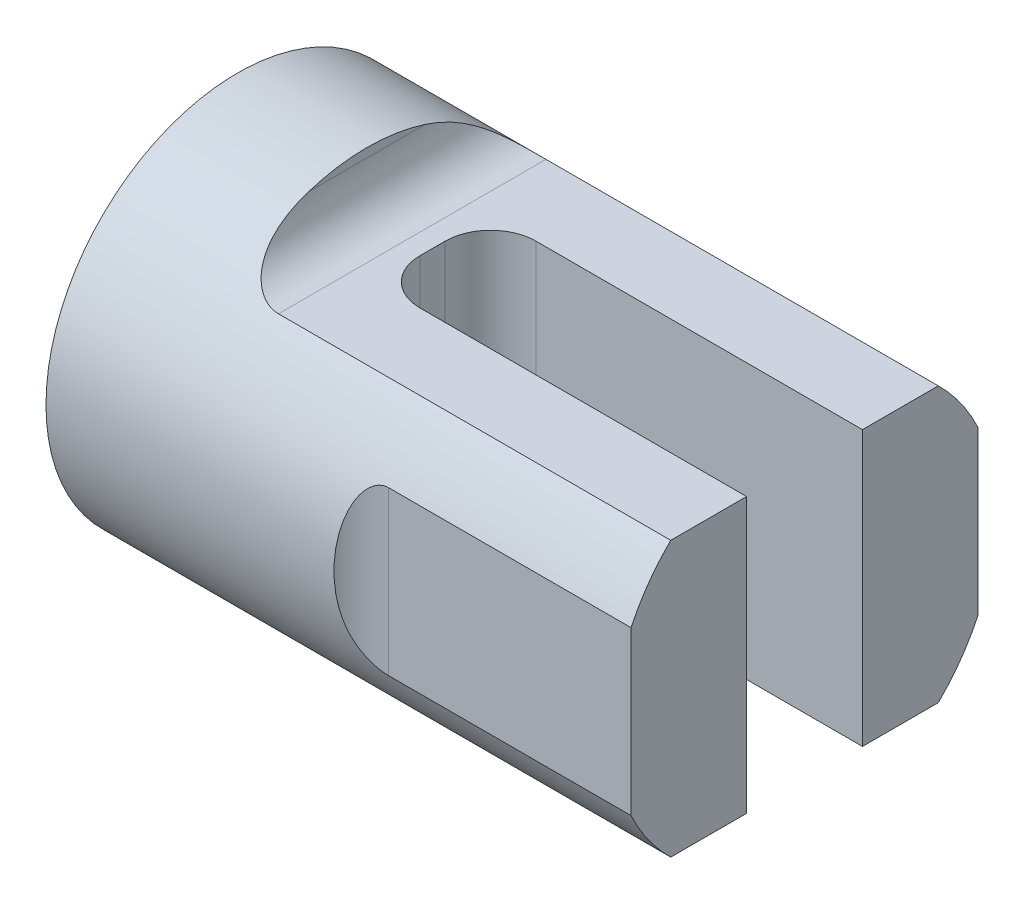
ISO-10303-21;
HEADER;
FILE_DESCRIPTION(('STEP AP214'),'2;1');
FILE_NAME('part.step','',(''),(''),'','','');
FILE_SCHEMA(('AUTOMOTIVE_DESIGN { 1 0 10303 214 1 1 1 1 }'));
ENDSEC;
DATA;
#1=APPLICATION_CONTEXT('core data for automotive mechanical design processes');
#2=APPLICATION_PROTOCOL_DEFINITION('international standard','automotive_design',2000,#1);
#3=PRODUCT_CONTEXT('',#1,'mechanical');
#4=PRODUCT('Part','Part','',(#3));
#5=PRODUCT_RELATED_PRODUCT_CATEGORY('part','',(#4));
#6=PRODUCT_DEFINITION_FORMATION('','',#4);
#7=PRODUCT_DEFINITION_CONTEXT('part definition',#1,'design');
#8=PRODUCT_DEFINITION('design','',#6,#7);
#9=PRODUCT_DEFINITION_SHAPE('','',#8);
#10=(LENGTH_UNIT() NAMED_UNIT(*) SI_UNIT(.MILLI.,.METRE.));
#11=(NAMED_UNIT(*) PLANE_ANGLE_UNIT() SI_UNIT($,.RADIAN.));
#12=(NAMED_UNIT(*) SI_UNIT($,.STERADIAN.) SOLID_ANGLE_UNIT());
#13=UNCERTAINTY_MEASURE_WITH_UNIT(LENGTH_MEASURE(1.E-05),#10,'distance_accuracy_value','');
#14=(GEOMETRIC_REPRESENTATION_CONTEXT(3) GLOBAL_UNCERTAINTY_ASSIGNED_CONTEXT((#13)) GLOBAL_UNIT_ASSIGNED_CONTEXT((#10,
#11,#12)) REPRESENTATION_CONTEXT('',''));
#15=CARTESIAN_POINT('',(0.,0.,0.));
#16=DIRECTION('',(0.,0.,1.));
#17=DIRECTION('',(1.,0.,0.));
#18=AXIS2_PLACEMENT_3D('',#15,#16,#17);
#19=CARTESIAN_POINT('',(-950.,6304.,0.));
#20=DIRECTION('',(1.,0.,0.));
#21=DIRECTION('',(0.,0.,-1.));
#22=AXIS2_PLACEMENT_3D('',#19,#20,#21);
#23=PLANE('',#22);
#24=DIRECTION('',(0.,-1.,0.));
#25=VECTOR('',#24,1.);
#26=CARTESIAN_POINT('',(-950.,6304.,51.1));
#27=LINE('',#26,#25);
#28=CARTESIAN_POINT('',(-950.000000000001,6256.,51.1));
#29=VERTEX_POINT('',#28);
#30=CARTESIAN_POINT('',(-950.000000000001,6014.,51.1));
#31=VERTEX_POINT('',#30);
#32=EDGE_CURVE('E184',#29,#31,#27,.T.);
#33=ORIENTED_EDGE('',*,*,#32,.F.);
#34=DIRECTION('',(0.,0.,-1.));
#35=VECTOR('',#34,1.);
#36=CARTESIAN_POINT('',(-950.,6256.,129.620723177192));
#37=LINE('',#36,#35);
#38=CARTESIAN_POINT('',(-950.,6256.,117.98304963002));
#39=VERTEX_POINT('',#38);
#40=EDGE_CURVE('E265',#39,#29,#37,.T.);
#41=ORIENTED_EDGE('',*,*,#40,.F.);
#42=CARTESIAN_POINT('',(-950.,6135.,0.));
#43=DIRECTION('',(1.,0.,0.));
#44=DIRECTION('',(0.,0.,-1.));
#45=AXIS2_PLACEMENT_3D('',#42,#43,#44);
#46=CIRCLE('',#45,169.);
#47=CARTESIAN_POINT('',(-950.,6206.7774337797,153.));
#48=VERTEX_POINT('',#47);
#49=EDGE_CURVE('E282',#39,#48,#46,.T.);
#50=ORIENTED_EDGE('',*,*,#49,.T.);
#51=DIRECTION('',(0.,-1.,0.));
#52=VECTOR('',#51,1.);
#53=CARTESIAN_POINT('',(-950.,6264.38910783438,153.));
#54=LINE('',#53,#52);
#55=CARTESIAN_POINT('',(-950.,6063.2225662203,153.));
#56=VERTEX_POINT('',#55);
#57=EDGE_CURVE('E273',#48,#56,#54,.T.);
#58=ORIENTED_EDGE('',*,*,#57,.T.);
#59=CARTESIAN_POINT('',(-950.,6014.,117.98304963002));
#60=VERTEX_POINT('',#59);
#61=EDGE_CURVE('E283',#56,#60,#46,.T.);
#62=ORIENTED_EDGE('',*,*,#61,.T.);
#63=DIRECTION('',(0.,0.,-1.));
#64=VECTOR('',#63,1.);
#65=CARTESIAN_POINT('',(-950.,6014.,129.620723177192));
#66=LINE('',#65,#64);
#67=EDGE_CURVE('E261',#60,#31,#66,.T.);
#68=ORIENTED_EDGE('',*,*,#67,.T.);
#69=EDGE_LOOP('',(#33,#41,#50,#58,#62,#68));
#70=FACE_BOUND('',#69,.T.);
#71=ADVANCED_FACE('F29',(#70),#23,.T.);
#72=CARTESIAN_POINT('',(-464.758389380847,6135.,0.));
#73=DIRECTION('',(1.,0.,0.));
#74=DIRECTION('',(0.,0.,-1.));
#75=AXIS2_PLACEMENT_3D('',#72,#73,#74);
#76=CYLINDRICAL_SURFACE('',#75,169.);
#77=CARTESIAN_POINT('',(-1450.,6135.,0.));
#78=DIRECTION('',(1.,0.,0.));
#79=DIRECTION('',(0.,0.,-1.));
#80=AXIS2_PLACEMENT_3D('',#77,#78,#79);
#81=CIRCLE('',#80,169.);
#82=CARTESIAN_POINT('',(-1450.,6135.,-169.));
#83=VERTEX_POINT('',#82);
#84=EDGE_CURVE('E279',#83,#83,#81,.T.);
#85=ORIENTED_EDGE('',*,*,#84,.T.);
#86=EDGE_LOOP('',(#85));
#87=FACE_BOUND('',#86,.T.);
#88=DIRECTION('',(1.,0.,0.));
#89=VECTOR('',#88,1.);
#90=CARTESIAN_POINT('',(-464.758389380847,6063.2225662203,153.));
#91=LINE('',#90,#89);
#92=CARTESIAN_POINT('',(-1164.,6063.2225662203,153.));
#93=VERTEX_POINT('',#92);
#94=EDGE_CURVE('E291',#56,#93,#91,.F.);
#95=ORIENTED_EDGE('',*,*,#94,.T.);
#96=CARTESIAN_POINT('',(-1164.,6206.7774337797,153.));
#97=CARTESIAN_POINT('',(-1163.49313504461,6206.7774274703,153.000003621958));
#98=CARTESIAN_POINT('',(-1162.98611763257,6206.75685176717,153.009660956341));
#99=CARTESIAN_POINT('',(-1161.97589863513,6206.67494976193,153.048043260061));
#100=CARTESIAN_POINT('',(-1161.47269959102,6206.61359838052,153.076779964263));
#101=CARTESIAN_POINT('',(-1160.47301809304,6206.45122336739,153.152638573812));
#102=CARTESIAN_POINT('',(-1159.97655290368,6206.35011252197,153.199800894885));
#103=CARTESIAN_POINT('',(-1158.99490487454,6206.11022004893,153.31129783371));
#104=CARTESIAN_POINT('',(-1158.50972055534,6205.97144339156,153.375630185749));
#105=CARTESIAN_POINT('',(-1157.55668747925,6205.65981676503,153.519443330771));
#106=CARTESIAN_POINT('',(-1157.08873987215,6205.48721649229,153.598812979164));
#107=CARTESIAN_POINT('',(-1156.16858936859,6205.11005321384,153.7713348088));
#108=CARTESIAN_POINT('',(-1155.71638662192,6204.90548990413,153.864487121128));
#109=CARTESIAN_POINT('',(-1154.82928728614,6204.46731223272,154.062812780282));
#110=CARTESIAN_POINT('',(-1154.39438426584,6204.23370880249,154.167981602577));
#111=CARTESIAN_POINT('',(-1153.54248054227,6203.74015233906,154.388680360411));
#112=CARTESIAN_POINT('',(-1153.12548432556,6203.48019275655,154.504212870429));
#113=CARTESIAN_POINT('',(-1152.06008162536,6202.77012633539,154.81743724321));
#114=CARTESIAN_POINT('',(-1151.42629963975,6202.30104512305,155.022124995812));
#115=CARTESIAN_POINT('',(-1150.2062383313,6201.31138183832,155.448033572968));
#116=CARTESIAN_POINT('',(-1149.61998417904,6200.79077279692,155.669263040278));
#117=CARTESIAN_POINT('',(-1148.49206288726,6199.70542323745,156.123525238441));
#118=CARTESIAN_POINT('',(-1147.95050818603,6199.14057800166,156.356585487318));
#119=CARTESIAN_POINT('',(-1146.91105542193,6197.97504159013,156.829651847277));
#120=CARTESIAN_POINT('',(-1146.41315509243,6197.37435227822,157.069657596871));
#121=CARTESIAN_POINT('',(-1145.53603488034,6196.24347238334,157.51363021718));
#122=CARTESIAN_POINT('',(-1145.15070956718,6195.7177811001,157.717084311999));
#123=CARTESIAN_POINT('',(-1144.40671245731,6194.6480597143,158.124750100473));
#124=CARTESIAN_POINT('',(-1144.04804455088,6194.10402695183,158.328961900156));
#125=CARTESIAN_POINT('',(-1143.35550581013,6192.99976660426,158.73680656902));
#126=CARTESIAN_POINT('',(-1143.02164921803,6192.43952997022,158.940439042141));
#127=CARTESIAN_POINT('',(-1142.37730462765,6191.30517548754,159.345818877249));
#128=CARTESIAN_POINT('',(-1142.06681572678,6190.73105817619,159.547566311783));
#129=CARTESIAN_POINT('',(-1141.4671662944,6189.56972989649,159.948499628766));
#130=CARTESIAN_POINT('',(-1141.17803896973,6188.98250031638,160.147681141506));
#131=CARTESIAN_POINT('',(-1140.62016307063,6187.79723992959,160.542335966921));
#132=CARTESIAN_POINT('',(-1140.35141445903,6187.19920914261,160.737809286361));
#133=CARTESIAN_POINT('',(-1139.83298215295,6185.99370643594,161.124307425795));
#134=CARTESIAN_POINT('',(-1139.58329429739,6185.38623661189,161.315333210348));
#135=CARTESIAN_POINT('',(-1139.10165278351,6184.16276475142,161.69240095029));
#136=CARTESIAN_POINT('',(-1138.86970016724,6183.54676221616,161.878442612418));
#137=CARTESIAN_POINT('',(-1138.22615027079,6181.76346137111,162.405818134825));
#138=CARTESIAN_POINT('',(-1137.8354335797,6180.58652607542,162.74023253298));
#139=CARTESIAN_POINT('',(-1137.10550848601,6178.21078981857,163.387099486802));
#140=CARTESIAN_POINT('',(-1136.76630913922,6177.01198505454,163.699548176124));
#141=CARTESIAN_POINT('',(-1136.13347055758,6174.5956503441,164.300747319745));
#142=CARTESIAN_POINT('',(-1135.83986314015,6173.37810796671,164.589481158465));
#143=CARTESIAN_POINT('',(-1135.29359122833,6170.92829830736,165.141557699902));
#144=CARTESIAN_POINT('',(-1135.04092467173,6169.69603177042,165.404901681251));
#145=CARTESIAN_POINT('',(-1134.57173607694,6167.21595901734,165.905806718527));
#146=CARTESIAN_POINT('',(-1134.35531152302,6165.9681202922,166.143297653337));
#147=CARTESIAN_POINT('',(-1133.95589634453,6163.46224793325,166.590877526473));
#148=CARTESIAN_POINT('',(-1133.77290577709,6162.20421428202,166.800966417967));
#149=CARTESIAN_POINT('',(-1133.43745439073,6159.680080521,167.193075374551));
#150=CARTESIAN_POINT('',(-1133.28498579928,6158.41398254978,167.375102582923));
#151=CARTESIAN_POINT('',(-1133.0080958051,6155.87495138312,167.710692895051));
#152=CARTESIAN_POINT('',(-1132.88367546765,6154.60201792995,167.864254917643));
#153=CARTESIAN_POINT('',(-1132.61071155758,6151.47605384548,168.205241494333));
#154=CARTESIAN_POINT('',(-1132.47654660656,6149.61999938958,168.376761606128));
#155=CARTESIAN_POINT('',(-1132.25855629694,6145.90022632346,168.65842658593));
#156=CARTESIAN_POINT('',(-1132.17473483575,6144.03650713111,168.768566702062));
#157=CARTESIAN_POINT('',(-1132.05466111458,6140.3038828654,168.927085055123));
#158=CARTESIAN_POINT('',(-1132.01843520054,6138.43497549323,168.975429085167));
#159=CARTESIAN_POINT('',(-1131.99244601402,6134.69633030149,169.010066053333));
#160=CARTESIAN_POINT('',(-1132.0026812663,6132.82659251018,168.996360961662));
#161=CARTESIAN_POINT('',(-1132.06987595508,6129.09342238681,168.907048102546));
#162=CARTESIAN_POINT('',(-1132.12673547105,6127.22998511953,168.8315727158));
#163=CARTESIAN_POINT('',(-1132.28891887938,6123.50864293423,168.619163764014));
#164=CARTESIAN_POINT('',(-1132.39424501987,6121.65073827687,168.482227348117));
#165=CARTESIAN_POINT('',(-1132.65673140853,6117.9452562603,168.14753434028));
#166=CARTESIAN_POINT('',(-1132.81385630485,6116.09767272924,167.949819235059));
#167=CARTESIAN_POINT('',(-1133.09233468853,6113.33640251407,167.608320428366));
#168=CARTESIAN_POINT('',(-1133.19228889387,6112.41769161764,167.487004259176));
#169=CARTESIAN_POINT('',(-1133.40731878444,6110.58413387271,167.229549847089));
#170=CARTESIAN_POINT('',(-1133.5223939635,6109.66928689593,167.093412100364));
#171=CARTESIAN_POINT('',(-1133.76487622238,6107.87182112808,166.810863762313));
#172=CARTESIAN_POINT('',(-1133.89180176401,6106.98906842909,166.664891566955));
#173=CARTESIAN_POINT('',(-1134.16176657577,6105.22841683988,166.359403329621));
#174=CARTESIAN_POINT('',(-1134.30480512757,6104.35051773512,166.199887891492));
#175=CARTESIAN_POINT('',(-1134.60813688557,6102.60024463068,165.867565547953));
#176=CARTESIAN_POINT('',(-1134.76842974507,6101.72787052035,165.694758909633));
#177=CARTESIAN_POINT('',(-1135.10756444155,6099.98939988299,165.336159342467));
#178=CARTESIAN_POINT('',(-1135.28640646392,6099.12330341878,165.150366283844));
#179=CARTESIAN_POINT('',(-1135.66411990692,6097.39816426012,164.766146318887));
#180=CARTESIAN_POINT('',(-1135.86299414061,6096.53912257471,164.567717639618));
#181=CARTESIAN_POINT('',(-1136.28239193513,6094.82923085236,164.158709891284));
#182=CARTESIAN_POINT('',(-1136.50291568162,6093.97838088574,163.948130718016));
#183=CARTESIAN_POINT('',(-1136.96741666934,6092.28620317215,163.515424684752));
#184=CARTESIAN_POINT('',(-1137.21139030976,6091.44487398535,163.293299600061));
#185=CARTESIAN_POINT('',(-1137.72487909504,6089.77302108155,162.838173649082));
#186=CARTESIAN_POINT('',(-1137.9943932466,6088.94249694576,162.605173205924));
#187=CARTESIAN_POINT('',(-1138.49692155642,6087.48108369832,162.183206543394));
#188=CARTESIAN_POINT('',(-1138.72432913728,6086.8476823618,161.996253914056));
#189=CARTESIAN_POINT('',(-1139.19697196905,6085.58923866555,161.616857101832));
#190=CARTESIAN_POINT('',(-1139.44220658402,6084.96419600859,161.424413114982));
#191=CARTESIAN_POINT('',(-1139.95186033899,6083.72333384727,161.034550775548));
#192=CARTESIAN_POINT('',(-1140.21628441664,6083.10751676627,160.837131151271));
#193=CARTESIAN_POINT('',(-1140.76565952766,6081.88648761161,160.43804822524));
#194=CARTESIAN_POINT('',(-1141.05061043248,6081.28127547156,160.236384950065));
#195=CARTESIAN_POINT('',(-1141.64187420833,6080.08425325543,159.830095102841));
#196=CARTESIAN_POINT('',(-1141.94813647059,6079.49241557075,159.625476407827));
#197=CARTESIAN_POINT('',(-1142.58423400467,6078.32234847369,159.213782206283));
#198=CARTESIAN_POINT('',(-1142.91407031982,6077.74411966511,159.006706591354));
#199=CARTESIAN_POINT('',(-1143.59881703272,6076.60362209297,158.591396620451));
#200=CARTESIAN_POINT('',(-1143.95371169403,6076.04134361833,158.383163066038));
#201=CARTESIAN_POINT('',(-1144.69050645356,6074.93480497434,157.966837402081));
#202=CARTESIAN_POINT('',(-1145.07240221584,6074.39054193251,157.758745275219));
#203=CARTESIAN_POINT('',(-1145.89078138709,6073.28815169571,157.330923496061));
#204=CARTESIAN_POINT('',(-1146.32919806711,6072.73140692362,157.111312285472));
#205=CARTESIAN_POINT('',(-1147.24105281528,6071.6454443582,156.676553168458));
#206=CARTESIAN_POINT('',(-1147.71448966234,6071.11622560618,156.461405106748));
#207=CARTESIAN_POINT('',(-1148.69825540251,6070.09041227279,156.038626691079));
#208=CARTESIAN_POINT('',(-1149.20856693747,6069.59380254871,155.830992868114));
#209=CARTESIAN_POINT('',(-1150.26794420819,6068.63882382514,155.426712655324));
#210=CARTESIAN_POINT('',(-1150.81700293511,6068.18044794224,155.230064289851));
#211=CARTESIAN_POINT('',(-1151.85067290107,6067.38859757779,154.886568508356));
#212=CARTESIAN_POINT('',(-1152.32868945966,6067.04761704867,154.737193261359));
#213=CARTESIAN_POINT('',(-1153.31108853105,6066.40009414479,154.451216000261));
#214=CARTESIAN_POINT('',(-1153.81546398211,6066.09354261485,154.314610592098));
#215=CARTESIAN_POINT('',(-1154.84935164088,6065.51973316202,154.057104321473));
#216=CARTESIAN_POINT('',(-1155.37883878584,6065.25243710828,153.936188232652));
#217=CARTESIAN_POINT('',(-1156.46154705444,6064.76169081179,153.712890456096));
#218=CARTESIAN_POINT('',(-1157.01476321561,6064.53823145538,153.610504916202));
#219=CARTESIAN_POINT('',(-1158.04079674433,6064.17564503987,153.443615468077));
#220=CARTESIAN_POINT('',(-1158.51024698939,6064.02858116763,153.375610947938));
#221=CARTESIAN_POINT('',(-1159.46075005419,6063.76960380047,153.255509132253));
#222=CARTESIAN_POINT('',(-1159.94180161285,6063.65768650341,153.203410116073));
#223=CARTESIAN_POINT('',(-1160.91238454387,6063.471070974,153.11637060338));
#224=CARTESIAN_POINT('',(-1161.40191165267,6063.39635456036,153.081421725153));
#225=CARTESIAN_POINT('',(-1162.38629278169,6063.28550951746,153.029525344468));
#226=CARTESIAN_POINT('',(-1162.88114687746,6063.24938143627,153.012578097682));
#227=CARTESIAN_POINT('',(-1163.87344763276,6063.21641761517,152.997116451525));
#228=CARTESIAN_POINT('',(-1164.3708974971,6063.21966054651,152.998638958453));
#229=CARTESIAN_POINT('',(-1165.36356381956,6063.26556205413,153.020165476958));
#230=CARTESIAN_POINT('',(-1165.85878027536,6063.30822067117,153.04016950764));
#231=CARTESIAN_POINT('',(-1166.84342432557,6063.43210544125,153.098142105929));
#232=CARTESIAN_POINT('',(-1167.33285015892,6063.51334303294,153.136116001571));
#233=CARTESIAN_POINT('',(-1168.30242613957,6063.71281907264,153.229076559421));
#234=CARTESIAN_POINT('',(-1168.78257615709,6063.83105803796,153.284063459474));
#235=CARTESIAN_POINT('',(-1169.72157725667,6064.09978335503,153.40854190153));
#236=CARTESIAN_POINT('',(-1170.18066070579,6064.24960129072,153.477732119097));
#237=CARTESIAN_POINT('',(-1171.08504490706,6064.58042305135,153.629802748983));
#238=CARTESIAN_POINT('',(-1171.5303461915,6064.76142567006,153.71268263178));
#239=CARTESIAN_POINT('',(-1172.40568053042,6065.15213059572,153.890614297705));
#240=CARTESIAN_POINT('',(-1172.83571182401,6065.36183619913,153.985667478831));
#241=CARTESIAN_POINT('',(-1173.67947726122,6065.80740507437,154.186395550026));
#242=CARTESIAN_POINT('',(-1174.09320748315,6066.04327458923,154.292072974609));
#243=CARTESIAN_POINT('',(-1175.14021273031,6066.68324511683,154.576857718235));
#244=CARTESIAN_POINT('',(-1175.76076512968,6067.10521707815,154.762838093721));
#245=CARTESIAN_POINT('',(-1176.9587876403,6067.99941632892,155.152053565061));
#246=CARTESIAN_POINT('',(-1177.53623637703,6068.4716682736,155.355297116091));
#247=CARTESIAN_POINT('',(-1178.65009858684,6069.45948712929,155.774611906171));
#248=CARTESIAN_POINT('',(-1179.18641643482,6069.9751494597,155.990711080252));
#249=CARTESIAN_POINT('',(-1180.21843490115,6071.04209942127,156.431199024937));
#250=CARTESIAN_POINT('',(-1180.71413697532,6071.59338577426,156.655587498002));
#251=CARTESIAN_POINT('',(-1181.58151209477,6072.62405486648,157.068430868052));
#252=CARTESIAN_POINT('',(-1181.95945179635,6073.09852364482,157.256085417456));
#253=CARTESIAN_POINT('',(-1182.6910994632,6074.06519171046,157.633176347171));
#254=CARTESIAN_POINT('',(-1183.04480405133,6074.55739345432,157.822612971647));
#255=CARTESIAN_POINT('',(-1183.72951317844,6075.55752465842,158.202017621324));
#256=CARTESIAN_POINT('',(-1184.06050530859,6076.06546249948,158.391985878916));
#257=CARTESIAN_POINT('',(-1184.70096053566,6077.09492631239,158.771229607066));
#258=CARTESIAN_POINT('',(-1185.01042441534,6077.61645178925,158.960505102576));
#259=CARTESIAN_POINT('',(-1185.60963190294,6078.67232566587,159.33771648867));
#260=CARTESIAN_POINT('',(-1185.8993443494,6079.2066926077,159.525649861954));
#261=CARTESIAN_POINT('',(-1186.45979372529,6080.28609824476,159.899077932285));
#262=CARTESIAN_POINT('',(-1186.73053069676,6080.83113691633,160.084572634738));
#263=CARTESIAN_POINT('',(-1187.25417115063,6081.93059811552,160.452405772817));
#264=CARTESIAN_POINT('',(-1187.50707830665,6082.48501868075,160.634744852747));
#265=CARTESIAN_POINT('',(-1187.99623780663,6083.60235647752,160.995736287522));
#266=CARTESIAN_POINT('',(-1188.23248915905,6084.1652742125,161.174388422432));
#267=CARTESIAN_POINT('',(-1188.88805266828,6085.79157130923,161.68104808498));
#268=CARTESIAN_POINT('',(-1189.28790137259,6086.8644737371,162.003838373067));
#269=CARTESIAN_POINT('',(-1190.03911832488,6089.03212957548,162.632189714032));
#270=CARTESIAN_POINT('',(-1190.39047798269,6090.12688681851,162.937747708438));
#271=CARTESIAN_POINT('',(-1191.05011414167,6092.33519706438,163.529881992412));
#272=CARTESIAN_POINT('',(-1191.35836061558,6093.44876256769,163.816444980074));
#273=CARTESIAN_POINT('',(-1191.93596764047,6095.69088893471,164.368874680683));
#274=CARTESIAN_POINT('',(-1192.20533015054,6096.81944903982,164.634742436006));
#275=CARTESIAN_POINT('',(-1192.70967703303,6099.09199705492,165.145314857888));
#276=CARTESIAN_POINT('',(-1192.94457492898,6100.23601616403,165.389965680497));
#277=CARTESIAN_POINT('',(-1193.3825294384,6102.53471047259,165.856505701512));
#278=CARTESIAN_POINT('',(-1193.58558602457,6103.68938568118,166.078394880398));
#279=CARTESIAN_POINT('',(-1193.96265380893,6106.00739643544,166.498696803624));
#280=CARTESIAN_POINT('',(-1194.13667220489,6107.1707297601,166.697115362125));
#281=CARTESIAN_POINT('',(-1194.45812509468,6109.50489423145,167.070035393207));
#282=CARTESIAN_POINT('',(-1194.60555844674,6110.67572569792,167.244535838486));
#283=CARTESIAN_POINT('',(-1194.95053481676,6113.67195988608,167.65887401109));
#284=CARTESIAN_POINT('',(-1195.13078622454,6115.50176683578,167.881574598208));
#285=CARTESIAN_POINT('',(-1195.43810282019,6119.17217769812,168.267305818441));
#286=CARTESIAN_POINT('',(-1195.56516292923,6121.01278262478,168.430330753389));
#287=CARTESIAN_POINT('',(-1195.77025106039,6124.70210506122,168.696104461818));
#288=CARTESIAN_POINT('',(-1195.84825117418,6126.55082658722,168.798818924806));
#289=CARTESIAN_POINT('',(-1195.95762920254,6130.25194164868,168.943439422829));
#290=CARTESIAN_POINT('',(-1195.98900872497,6132.1043350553,168.985347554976));
#291=CARTESIAN_POINT('',(-1196.0061564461,6135.80825124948,169.008206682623));
#292=CARTESIAN_POINT('',(-1195.99196045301,6137.65977357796,168.989205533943));
#293=CARTESIAN_POINT('',(-1195.91757712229,6141.36035051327,168.89041409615));
#294=CARTESIAN_POINT('',(-1195.8573881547,6143.20940503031,168.810621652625));
#295=CARTESIAN_POINT('',(-1195.68912085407,6146.90067164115,168.59060065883));
#296=CARTESIAN_POINT('',(-1195.58106992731,6148.74288704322,168.450406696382));
#297=CARTESIAN_POINT('',(-1195.31360857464,6152.41794645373,168.110141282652));
#298=CARTESIAN_POINT('',(-1195.15420348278,6154.25079141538,167.91007605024));
#299=CARTESIAN_POINT('',(-1194.85719540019,6157.14052464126,167.546849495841));
#300=CARTESIAN_POINT('',(-1194.73828362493,6158.20184230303,167.403163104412));
#301=CARTESIAN_POINT('',(-1194.4799179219,6160.3190943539,167.096042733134));
#302=CARTESIAN_POINT('',(-1194.34046474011,6161.37502893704,166.932609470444));
#303=CARTESIAN_POINT('',(-1194.03945296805,6163.48061171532,166.586293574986));
#304=CARTESIAN_POINT('',(-1193.87789305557,6164.53025953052,166.403409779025));
#305=CARTESIAN_POINT('',(-1193.53084616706,6166.62210394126,166.018593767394));
#306=CARTESIAN_POINT('',(-1193.34535905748,6167.66430049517,165.816661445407));
#307=CARTESIAN_POINT('',(-1192.94864832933,6169.73835083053,165.394574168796));
#308=CARTESIAN_POINT('',(-1192.73746498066,6170.77021812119,165.174447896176));
#309=CARTESIAN_POINT('',(-1192.28669534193,6172.82378044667,164.716327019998));
#310=CARTESIAN_POINT('',(-1192.04710839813,6173.84547524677,164.478332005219));
#311=CARTESIAN_POINT('',(-1191.53681494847,6175.87658687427,163.985353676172));
#312=CARTESIAN_POINT('',(-1191.26611884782,6176.88600768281,163.730376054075));
#313=CARTESIAN_POINT('',(-1190.69035857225,6178.8906813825,163.204418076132));
#314=CARTESIAN_POINT('',(-1190.38529743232,6179.88593551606,162.933439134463));
#315=CARTESIAN_POINT('',(-1189.66805184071,6182.07015003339,162.317426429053));
#316=CARTESIAN_POINT('',(-1189.24688905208,6183.25523019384,161.968910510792));
#317=CARTESIAN_POINT('',(-1188.56743056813,6185.01010919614,161.43222700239));
#318=CARTESIAN_POINT('',(-1188.33296431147,6185.59133978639,161.250994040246));
#319=CARTESIAN_POINT('',(-1187.84702747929,6186.74531255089,160.884396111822));
#320=CARTESIAN_POINT('',(-1187.59555801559,6187.31805527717,160.699031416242));
#321=CARTESIAN_POINT('',(-1187.07463168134,6188.45365526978,160.324869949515));
#322=CARTESIAN_POINT('',(-1186.80518732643,6189.01651907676,160.136075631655));
#323=CARTESIAN_POINT('',(-1186.24693044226,6190.13153245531,159.755629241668));
#324=CARTESIAN_POINT('',(-1185.95811953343,6190.68368291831,159.563977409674));
#325=CARTESIAN_POINT('',(-1185.3598581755,6191.77578100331,159.178660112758));
#326=CARTESIAN_POINT('',(-1185.05041355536,6192.3157320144,158.984995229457));
#327=CARTESIAN_POINT('',(-1184.40943750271,6193.38190244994,158.59658071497));
#328=CARTESIAN_POINT('',(-1184.07790798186,6193.90812305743,158.401831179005));
#329=CARTESIAN_POINT('',(-1183.2875230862,6195.10162295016,157.953519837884));
#330=CARTESIAN_POINT('',(-1182.8204522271,6195.76350827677,157.699958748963));
#331=CARTESIAN_POINT('',(-1181.84292786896,6197.05582149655,157.195916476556));
#332=CARTESIAN_POINT('',(-1181.33247296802,6197.68624837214,156.945435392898));
#333=CARTESIAN_POINT('',(-1180.26539423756,6198.90864626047,156.45164923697));
#334=CARTESIAN_POINT('',(-1179.70882624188,6199.50066227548,156.208335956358));
#335=CARTESIAN_POINT('',(-1178.54652644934,6200.63887547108,155.733486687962));
#336=CARTESIAN_POINT('',(-1177.94081189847,6201.18508858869,155.501946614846));
#337=CARTESIAN_POINT('',(-1176.39657996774,6202.45328279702,154.957143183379));
#338=CARTESIAN_POINT('',(-1175.42958945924,6203.14580288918,154.653168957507));
#339=CARTESIAN_POINT('',(-1173.89995989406,6204.07147531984,154.240873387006));
#340=CARTESIAN_POINT('',(-1173.3768727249,6204.36118980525,154.110715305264));
#341=CARTESIAN_POINT('',(-1172.30534223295,6204.89822131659,153.867882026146));
#342=CARTESIAN_POINT('',(-1171.756904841,6205.14554819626,153.755202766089));
#343=CARTESIAN_POINT('',(-1170.73531488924,6205.553577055,153.568336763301));
#344=CARTESIAN_POINT('',(-1170.26578239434,6205.72186400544,153.490864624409));
#345=CARTESIAN_POINT('',(-1169.31337699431,6206.02344138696,153.351551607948));
#346=CARTESIAN_POINT('',(-1168.83050705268,6206.15673952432,153.289707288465));
#347=CARTESIAN_POINT('',(-1167.8552358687,6206.38572702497,153.183203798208));
#348=CARTESIAN_POINT('',(-1167.36285901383,6206.48150190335,153.138505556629));
#349=CARTESIAN_POINT('',(-1166.37098392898,6206.63398083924,153.067239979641));
#350=CARTESIAN_POINT('',(-1165.87149010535,6206.69070808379,153.040661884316));
#351=CARTESIAN_POINT('',(-1165.14244218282,6206.74403212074,153.01566623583));
#352=CARTESIAN_POINT('',(-1164.91419688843,6206.75655020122,153.009795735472));
#353=CARTESIAN_POINT('',(-1164.4573114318,6206.77325288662,153.001961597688));
#354=CARTESIAN_POINT('',(-1164.22867123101,6206.77743662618,152.99999836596));
#355=CARTESIAN_POINT('',(-1164.,6206.7774337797,153.));
#356=B_SPLINE_CURVE_WITH_KNOTS('',3,(#96,#97,#98,#99,#100,#101,#102,#103,#104,#105,#106,#107,
#108,#109,#110,#111,#112,#113,#114,#115,#116,#117,#118,#119,#120,#121,#122,#123,#124,#125,#126,
#127,#128,#129,#130,#131,#132,#133,#134,#135,#136,#137,#138,#139,#140,#141,#142,#143,#144,#145,
#146,#147,#148,#149,#150,#151,#152,#153,#154,#155,#156,#157,#158,#159,#160,#161,#162,#163,#164,
#165,#166,#167,#168,#169,#170,#171,#172,#173,#174,#175,#176,#177,#178,#179,#180,#181,#182,#183,
#184,#185,#186,#187,#188,#189,#190,#191,#192,#193,#194,#195,#196,#197,#198,#199,#200,#201,#202,
#203,#204,#205,#206,#207,#208,#209,#210,#211,#212,#213,#214,#215,#216,#217,#218,#219,#220,#221,
#222,#223,#224,#225,#226,#227,#228,#229,#230,#231,#232,#233,#234,#235,#236,#237,#238,#239,#240,
#241,#242,#243,#244,#245,#246,#247,#248,#249,#250,#251,#252,#253,#254,#255,#256,#257,#258,#259,
#260,#261,#262,#263,#264,#265,#266,#267,#268,#269,#270,#271,#272,#273,#274,#275,#276,#277,#278,
#279,#280,#281,#282,#283,#284,#285,#286,#287,#288,#289,#290,#291,#292,#293,#294,#295,#296,#297,
#298,#299,#300,#301,#302,#303,#304,#305,#306,#307,#308,#309,#310,#311,#312,#313,#314,#315,#316,
#317,#318,#319,#320,#321,#322,#323,#324,#325,#326,#327,#328,#329,#330,#331,#332,#333,#334,#335,
#336,#337,#338,#339,#340,#341,#342,#343,#344,#345,#346,#347,#348,#349,#350,#351,#352,#353,#354,
#355),.UNSPECIFIED.,.T.,.F.,(4,2,2,2,2,2,2,2,2,2,2,2,2,2,2,2,2,2,2,2,2,2,2,2,2,2,2,2,2,2,2,2,2,
2,2,2,2,2,2,2,2,2,2,2,2,2,2,2,2,2,2,2,2,2,2,2,2,2,2,2,2,2,2,2,2,2,2,2,2,2,2,2,2,2,2,2,2,2,2,2,2,
2,2,2,2,2,2,2,2,2,2,2,2,2,2,2,2,2,2,2,2,2,2,2,2,2,2,2,2,2,2,2,2,2,2,2,2,2,2,2,2,2,2,2,2,2,2,2,2,
4),(0.,1.52035554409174,3.04164705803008,4.56629435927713,6.09074057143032,7.60433022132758,
9.11793426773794,10.6309702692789,12.1443831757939,14.5843526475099,17.0256059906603,
19.4728239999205,21.919914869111,23.9675277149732,26.0154387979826,28.0645164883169,
30.1135149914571,32.1656344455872,34.2177501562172,36.2694165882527,38.3212034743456,
42.1726555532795,46.0247838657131,49.8795885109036,53.7341989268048,57.5990165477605,
61.4638407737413,65.3276795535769,69.191665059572,74.7961564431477,80.4010816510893,
86.0091080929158,91.6169564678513,97.2128179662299,102.808939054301,108.40124875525,
111.19723022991,113.993118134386,116.703967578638,119.41469621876,122.125370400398,
124.836071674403,127.547154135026,130.25825984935,132.968949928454,135.679534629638,
137.774681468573,139.869753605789,141.965366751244,144.060966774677,146.151749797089,
148.2426254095,150.332199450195,152.421438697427,154.645892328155,156.870268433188,
159.093604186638,161.316538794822,163.132657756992,164.94829263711,166.762152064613,
168.575633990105,170.063996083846,171.552197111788,173.03967009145,174.527164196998,
176.017631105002,177.508099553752,178.999010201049,180.489941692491,181.952017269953,
183.41403630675,184.876223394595,186.338760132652,188.654483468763,190.971347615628,
193.293444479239,195.615458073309,197.519602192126,199.424011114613,201.329452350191,
203.234824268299,205.14313583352,207.051443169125,208.959356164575,210.867382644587,
214.434619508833,218.002487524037,221.57282822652,225.142988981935,228.721959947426,
232.300933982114,235.879019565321,239.457258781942,245.011594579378,250.566460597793,
256.124483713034,261.68231513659,267.235780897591,272.78944347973,278.339930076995,
283.889840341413,287.122249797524,290.354541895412,293.587027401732,296.819530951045,
300.047032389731,303.274608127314,306.501107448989,309.72732204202,313.640523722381,
315.597544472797,317.554437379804,319.509981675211,321.465362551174,323.420193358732,
325.374855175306,327.919827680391,330.464882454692,333.006899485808,335.548028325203,
339.215968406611,341.050068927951,342.88374250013,344.396538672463,345.909001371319,
347.417996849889,348.92609549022,349.611930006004,350.297835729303),.UNSPECIFIED.);
#357=CARTESIAN_POINT('',(-1164.,6206.7774337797,153.));
#358=VERTEX_POINT('',#357);
#359=EDGE_CURVE('E186',#93,#358,#356,.T.);
#360=ORIENTED_EDGE('',*,*,#359,.T.);
#361=DIRECTION('',(1.,0.,0.));
#362=VECTOR('',#361,1.);
#363=CARTESIAN_POINT('',(-464.758389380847,6206.7774337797,153.));
#364=LINE('',#363,#362);
#365=EDGE_CURVE('E286',#358,#48,#364,.T.);
#366=ORIENTED_EDGE('',*,*,#365,.T.);
#367=ORIENTED_EDGE('',*,*,#49,.F.);
#368=DIRECTION('',(1.,0.,0.));
#369=VECTOR('',#368,1.);
#370=CARTESIAN_POINT('',(-464.758389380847,6256.,117.98304963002));
#371=LINE('',#370,#369);
#372=CARTESIAN_POINT('',(-1296.,6256.,117.98304963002));
#373=VERTEX_POINT('',#372);
#374=EDGE_CURVE('E301',#373,#39,#371,.T.);
#375=ORIENTED_EDGE('',*,*,#374,.F.);
#376=CARTESIAN_POINT('',(-1296.,6256.,117.98304963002));
#377=CARTESIAN_POINT('',(-1296.43140197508,6255.99998714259,117.983057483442));
#378=CARTESIAN_POINT('',(-1296.86279696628,6256.00697878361,117.975892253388));
#379=CARTESIAN_POINT('',(-1297.72464871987,6256.03487513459,117.947275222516));
#380=CARTESIAN_POINT('',(-1298.15510551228,6256.05577939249,117.925823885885));
#381=CARTESIAN_POINT('',(-1299.01395921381,6256.11139045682,117.868709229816));
#382=CARTESIAN_POINT('',(-1299.44235708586,6256.14609000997,117.833053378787));
#383=CARTESIAN_POINT('',(-1300.29638948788,6256.22909098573,117.747658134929));
#384=CARTESIAN_POINT('',(-1300.72202400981,6256.27739244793,117.69791870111));
#385=CARTESIAN_POINT('',(-1301.98772816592,6256.44160030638,117.528561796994));
#386=CARTESIAN_POINT('',(-1302.82267058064,6256.57720927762,117.388398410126));
#387=CARTESIAN_POINT('',(-1304.47191712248,6256.89842770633,117.054801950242));
#388=CARTESIAN_POINT('',(-1305.28621951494,6257.08404135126,116.861364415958));
#389=CARTESIAN_POINT('',(-1306.887307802,6257.50130371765,116.423887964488));
#390=CARTESIAN_POINT('',(-1307.67414081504,6257.73286854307,116.179941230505));
#391=CARTESIAN_POINT('',(-1309.21720158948,6258.23805101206,115.643928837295));
#392=CARTESIAN_POINT('',(-1309.97343011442,6258.51166760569,115.351864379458));
#393=CARTESIAN_POINT('',(-1311.4527955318,6259.09681913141,114.722117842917));
#394=CARTESIAN_POINT('',(-1312.17588398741,6259.40840727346,114.384371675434));
#395=CARTESIAN_POINT('',(-1313.5852528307,6260.06445545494,113.66669883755));
#396=CARTESIAN_POINT('',(-1314.27152865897,6260.40891955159,113.286766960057));
#397=CARTESIAN_POINT('',(-1315.81946116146,6261.24098965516,112.359754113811));
#398=CARTESIAN_POINT('',(-1316.66681591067,6261.73908419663,111.79813348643));
#399=CARTESIAN_POINT('',(-1318.29251183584,6262.77390846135,110.613953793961));
#400=CARTESIAN_POINT('',(-1319.0708342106,6263.3106486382,109.991378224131));
#401=CARTESIAN_POINT('',(-1320.55940931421,6264.41369575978,108.691411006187));
#402=CARTESIAN_POINT('',(-1321.2695820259,6264.98003628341,108.013956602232));
#403=CARTESIAN_POINT('',(-1322.62259373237,6266.13316633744,106.611054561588));
#404=CARTESIAN_POINT('',(-1323.26542976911,6266.71995676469,105.885604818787));
#405=CARTESIAN_POINT('',(-1324.31508295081,6267.73993845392,104.602007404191));
#406=CARTESIAN_POINT('',(-1324.73751147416,6268.17002655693,104.054035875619));
#407=CARTESIAN_POINT('',(-1325.5502628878,6269.03457801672,102.937991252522));
#408=CARTESIAN_POINT('',(-1325.94058270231,6269.46904178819,102.369916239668));
#409=CARTESIAN_POINT('',(-1326.69053285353,6270.34027104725,101.215286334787));
#410=CARTESIAN_POINT('',(-1327.05015438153,6270.77703715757,100.62872620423));
#411=CARTESIAN_POINT('',(-1327.74006192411,6271.65090684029,99.4388007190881));
#412=CARTESIAN_POINT('',(-1328.07034457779,6272.08801044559,98.8354334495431));
#413=CARTESIAN_POINT('',(-1329.02029362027,6273.39853320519,97.0005387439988));
#414=CARTESIAN_POINT('',(-1329.59808704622,6274.27001487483,95.7457372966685));
#415=CARTESIAN_POINT('',(-1330.65378173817,6275.99651645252,93.1845975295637));
#416=CARTESIAN_POINT('',(-1331.13168807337,6276.85153719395,91.8782618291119));
#417=CARTESIAN_POINT('',(-1331.92784861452,6278.39840420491,89.4406223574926));
#418=CARTESIAN_POINT('',(-1332.25943398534,6279.09392167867,88.3159487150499));
#419=CARTESIAN_POINT('',(-1332.86754125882,6280.46466201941,86.0395117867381));
#420=CARTESIAN_POINT('',(-1333.1440550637,6281.13988188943,84.8877445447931));
#421=CARTESIAN_POINT('',(-1333.64808572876,6282.46758958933,82.5597179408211));
#422=CARTESIAN_POINT('',(-1333.87557143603,6283.12006274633,81.3834435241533));
#423=CARTESIAN_POINT('',(-1334.28687006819,6284.39969003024,79.0098129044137));
#424=CARTESIAN_POINT('',(-1334.47068495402,6285.02684529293,77.8124576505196));
#425=CARTESIAN_POINT('',(-1334.80001245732,6286.25506304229,75.3972408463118));
#426=CARTESIAN_POINT('',(-1334.94547336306,6286.85608939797,74.1793539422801));
#427=CARTESIAN_POINT('',(-1335.20253413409,6288.02991269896,71.7265257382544));
#428=CARTESIAN_POINT('',(-1335.31413317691,6288.6027089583,70.4915840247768));
#429=CARTESIAN_POINT('',(-1335.50781962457,6289.71884972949,68.0068507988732));
#430=CARTESIAN_POINT('',(-1335.58991965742,6290.26220675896,66.7570658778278));
#431=CARTESIAN_POINT('',(-1335.72872888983,6291.31896448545,64.2435971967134));
#432=CARTESIAN_POINT('',(-1335.7854395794,6291.83236693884,62.9799142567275));
#433=CARTESIAN_POINT('',(-1335.86211404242,6292.66467395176,60.8579346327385));
#434=CARTESIAN_POINT('',(-1335.88802902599,6292.99197147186,60.003124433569));
#435=CARTESIAN_POINT('',(-1335.93117606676,6293.63266822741,58.2882004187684));
#436=CARTESIAN_POINT('',(-1335.94840911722,6293.94606904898,57.4280872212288));
#437=CARTESIAN_POINT('',(-1335.97515477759,6294.55765642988,55.7062438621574));
#438=CARTESIAN_POINT('',(-1335.98469810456,6294.85589901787,54.8445340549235));
#439=CARTESIAN_POINT('',(-1335.99711685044,6295.43844085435,53.1162729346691));
#440=CARTESIAN_POINT('',(-1335.99999162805,6295.72273875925,52.2497211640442));
#441=CARTESIAN_POINT('',(-1336.,6296.,51.3809303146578));
#442=B_SPLINE_CURVE_WITH_KNOTS('',3,(#376,#377,#378,#379,#380,#381,#382,#383,#384,#385,#386,
#387,#388,#389,#390,#391,#392,#393,#394,#395,#396,#397,#398,#399,#400,#401,#402,#403,#404,#405,
#406,#407,#408,#409,#410,#411,#412,#413,#414,#415,#416,#417,#418,#419,#420,#421,#422,#423,#424,
#425,#426,#427,#428,#429,#430,#431,#432,#433,#434,#435,#436,#437,#438,#439,#440,#441),
.UNSPECIFIED.,.F.,.F.,(4,2,2,2,2,2,2,2,2,2,2,2,2,2,2,2,2,2,2,2,2,2,2,2,2,2,2,2,2,2,2,2,4),(0.,
1.29407714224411,2.58811223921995,3.88146785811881,5.17482724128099,7.74331739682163,
10.3120227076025,12.8760806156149,15.440074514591,18.0077035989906,20.5756499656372,
23.9667887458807,27.3588482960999,30.754843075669,34.1509869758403,36.5941469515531,
39.0375406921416,41.4816332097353,43.9260053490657,48.8211491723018,53.7160445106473,
57.804326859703,61.8932099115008,65.9846834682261,70.0759732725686,74.1727513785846,
78.2696289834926,82.3647506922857,86.4596320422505,89.2065649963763,91.9531836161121,
94.6887755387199,97.4246305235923),.UNSPECIFIED.);
#443=CARTESIAN_POINT('',(-1336.,6296.,51.3809303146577));
#444=VERTEX_POINT('',#443);
#445=EDGE_CURVE('E11',#373,#444,#442,.T.);
#446=ORIENTED_EDGE('',*,*,#445,.T.);
#447=CARTESIAN_POINT('',(-1336.,6135.,0.));
#448=DIRECTION('',(1.,0.,0.));
#449=DIRECTION('',(0.,0.,-1.));
#450=AXIS2_PLACEMENT_3D('',#447,#448,#449);
#451=CIRCLE('',#450,169.);
#452=CARTESIAN_POINT('',(-1336.,6296.,-51.3809303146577));
#453=VERTEX_POINT('',#452);
#454=EDGE_CURVE('E299',#444,#453,#451,.F.);
#455=ORIENTED_EDGE('',*,*,#454,.T.);
#456=CARTESIAN_POINT('',(-1336.,6296.,-51.3809303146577));
#457=CARTESIAN_POINT('',(-1335.99999548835,6295.74499300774,-52.1799844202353));
#458=CARTESIAN_POINT('',(-1335.99756197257,6295.48404078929,-52.9771279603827));
#459=CARTESIAN_POINT('',(-1335.98711609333,6294.95030449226,-54.5674226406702));
#460=CARTESIAN_POINT('',(-1335.9791036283,6294.67752019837,-55.3605737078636));
#461=CARTESIAN_POINT('',(-1335.94561251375,6293.8414187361,-57.7340290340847));
#462=CARTESIAN_POINT('',(-1335.91067961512,6293.26044693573,-59.3080410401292));
#463=CARTESIAN_POINT('',(-1335.80909840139,6292.04948574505,-62.4443569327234));
#464=CARTESIAN_POINT('',(-1335.74230568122,6291.41928420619,-64.0065742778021));
#465=CARTESIAN_POINT('',(-1335.56994479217,6290.11329372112,-67.1096066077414));
#466=CARTESIAN_POINT('',(-1335.46437938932,6289.43750802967,-68.6504231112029));
#467=CARTESIAN_POINT('',(-1335.20512209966,6288.032880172,-71.7274983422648));
#468=CARTESIAN_POINT('',(-1335.05083518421,6287.30347251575,-73.2634498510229));
#469=CARTESIAN_POINT('',(-1334.6857198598,6285.80134265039,-76.3075066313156));
#470=CARTESIAN_POINT('',(-1334.47488605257,6285.02861631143,-77.8156092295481));
#471=CARTESIAN_POINT('',(-1333.98740948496,6283.44443395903,-80.7966168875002));
#472=CARTESIAN_POINT('',(-1333.71090098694,6282.63305962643,-82.2695870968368));
#473=CARTESIAN_POINT('',(-1333.08117690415,6280.97424615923,-85.1781659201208));
#474=CARTESIAN_POINT('',(-1332.72798337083,6280.12681744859,-86.6137851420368));
#475=CARTESIAN_POINT('',(-1332.16901958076,6278.91342922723,-88.6023652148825));
#476=CARTESIAN_POINT('',(-1332.00012854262,6278.56015089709,-89.1736030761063));
#477=CARTESIAN_POINT('',(-1331.64688141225,6277.84903617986,-90.3083669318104));
#478=CARTESIAN_POINT('',(-1331.46252610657,6277.49120002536,-90.8718933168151));
#479=CARTESIAN_POINT('',(-1330.88493210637,6276.41152944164,-92.5502470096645));
#480=CARTESIAN_POINT('',(-1330.4671661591,6275.68353471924,-93.6528458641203));
#481=CARTESIAN_POINT('',(-1329.55982585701,6274.21743490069,-95.8186485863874));
#482=CARTESIAN_POINT('',(-1329.07035739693,6273.47934614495,-96.881907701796));
#483=CARTESIAN_POINT('',(-1328.01180789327,6271.99848966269,-98.9648741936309));
#484=CARTESIAN_POINT('',(-1327.44272874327,6271.25572204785,-99.9845826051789));
#485=CARTESIAN_POINT('',(-1326.20966914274,6269.76406623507,-101.986392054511));
#486=CARTESIAN_POINT('',(-1325.54455089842,6269.01522403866,-102.967831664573));
#487=CARTESIAN_POINT('',(-1324.11799055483,6267.5318110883,-104.870273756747));
#488=CARTESIAN_POINT('',(-1323.35653450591,6266.79724241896,-105.791267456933));
#489=CARTESIAN_POINT('',(-1321.73288509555,6265.3570097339,-107.56090171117));
#490=CARTESIAN_POINT('',(-1320.87090158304,6264.65128951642,-108.409686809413));
#491=CARTESIAN_POINT('',(-1319.49955886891,6263.62568116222,-109.620778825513));
#492=CARTESIAN_POINT('',(-1319.02947340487,6263.28936357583,-110.01406452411));
#493=CARTESIAN_POINT('',(-1318.06277263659,6262.62970614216,-110.778665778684));
#494=CARTESIAN_POINT('',(-1317.56615165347,6262.306369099,-111.149976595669));
#495=CARTESIAN_POINT('',(-1316.38982406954,6261.57806737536,-111.979390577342));
#496=CARTESIAN_POINT('',(-1315.70075689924,6261.17855622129,-112.429096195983));
#497=CARTESIAN_POINT('',(-1314.27883614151,6260.41156867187,-113.284016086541));
#498=CARTESIAN_POINT('',(-1313.54599509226,6260.04408317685,-113.689243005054));
#499=CARTESIAN_POINT('',(-1312.03807709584,6259.34661924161,-114.451672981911));
#500=CARTESIAN_POINT('',(-1311.26298244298,6259.01665670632,-114.808855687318));
#501=CARTESIAN_POINT('',(-1309.67411812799,6258.40020705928,-115.471181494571));
#502=CARTESIAN_POINT('',(-1308.86034901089,6258.1137193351,-115.776325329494));
#503=CARTESIAN_POINT('',(-1307.19177286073,6257.58755533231,-116.333311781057));
#504=CARTESIAN_POINT('',(-1306.33667959,6257.34829048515,-116.58468739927));
#505=CARTESIAN_POINT('',(-1304.59744306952,6256.92462929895,-117.027685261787));
#506=CARTESIAN_POINT('',(-1303.7132940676,6256.74024389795,-117.219295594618));
#507=CARTESIAN_POINT('',(-1302.37242710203,6256.50825728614,-117.459590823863));
#508=CARTESIAN_POINT('',(-1301.92355227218,6256.4384147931,-117.531780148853));
#509=CARTESIAN_POINT('',(-1301.02148284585,6256.31383314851,-117.660367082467));
#510=CARTESIAN_POINT('',(-1300.56828882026,6256.25909202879,-117.716766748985));
#511=CARTESIAN_POINT('',(-1299.65893180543,6256.16507721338,-117.813533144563));
#512=CARTESIAN_POINT('',(-1299.20277109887,6256.12579279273,-117.853910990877));
#513=CARTESIAN_POINT('',(-1298.28829333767,6256.06287836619,-117.918537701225));
#514=CARTESIAN_POINT('',(-1297.82997669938,6256.03924545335,-117.942789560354));
#515=CARTESIAN_POINT('',(-1297.14268989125,6256.01567131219,-117.9669758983));
#516=CARTESIAN_POINT('',(-1296.91410889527,6256.00979245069,-117.973006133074));
#517=CARTESIAN_POINT('',(-1296.45702172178,6256.00195840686,-117.981041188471));
#518=CARTESIAN_POINT('',(-1296.22851567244,6255.99999957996,-117.983049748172));
#519=CARTESIAN_POINT('',(-1296.,6256.,-117.98304963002));
#520=B_SPLINE_CURVE_WITH_KNOTS('',3,(#456,#457,#458,#459,#460,#461,#462,#463,#464,#465,#466,
#467,#468,#469,#470,#471,#472,#473,#474,#475,#476,#477,#478,#479,#480,#481,#482,#483,#484,#485,
#486,#487,#488,#489,#490,#491,#492,#493,#494,#495,#496,#497,#498,#499,#500,#501,#502,#503,#504,
#505,#506,#507,#508,#509,#510,#511,#512,#513,#514,#515,#516,#517,#518,#519),.UNSPECIFIED.,.F.,
.F.,(4,2,2,2,2,2,2,2,2,2,2,2,2,2,2,2,2,2,2,2,2,2,2,2,2,2,2,2,2,2,2,4),(0.,2.51622133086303,
5.03248847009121,10.0659493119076,15.1224443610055,20.1785787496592,25.2990204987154,
30.4199512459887,35.530501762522,40.6395846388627,42.7170801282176,44.7944700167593,
48.9492605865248,53.0979758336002,57.2465924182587,61.4491540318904,65.6523248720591,
69.8468736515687,71.943406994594,74.0403908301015,76.7818479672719,79.5225235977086,
82.2643566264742,85.0061510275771,87.7708702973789,90.5361402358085,91.915625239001,
93.2949303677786,94.6732767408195,96.0513670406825,96.7375158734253,97.4230264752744),.UNSPECIFIED.);
#521=CARTESIAN_POINT('',(-1296.,6256.,-117.98304963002));
#522=VERTEX_POINT('',#521);
#523=EDGE_CURVE('E42',#453,#522,#520,.T.);
#524=ORIENTED_EDGE('',*,*,#523,.T.);
#525=DIRECTION('',(1.,0.,0.));
#526=VECTOR('',#525,1.);
#527=CARTESIAN_POINT('',(-464.758389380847,6256.,-117.98304963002));
#528=LINE('',#527,#526);
#529=CARTESIAN_POINT('',(-950.,6256.,-117.98304963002));
#530=VERTEX_POINT('',#529);
#531=EDGE_CURVE('E303',#530,#522,#528,.F.);
#532=ORIENTED_EDGE('',*,*,#531,.F.);
#533=CARTESIAN_POINT('',(-950.,6206.7774337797,-153.));
#534=VERTEX_POINT('',#533);
#535=EDGE_CURVE('E288',#534,#530,#46,.T.);
#536=ORIENTED_EDGE('',*,*,#535,.F.);
#537=DIRECTION('',(1.,0.,0.));
#538=VECTOR('',#537,1.);
#539=CARTESIAN_POINT('',(-464.758389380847,6206.7774337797,-153.));
#540=LINE('',#539,#538);
#541=CARTESIAN_POINT('',(-1164.,6206.7774337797,-153.));
#542=VERTEX_POINT('',#541);
#543=EDGE_CURVE('E294',#542,#534,#540,.T.);
#544=ORIENTED_EDGE('',*,*,#543,.F.);
#545=CARTESIAN_POINT('',(-1196.,6135.,-169.));
#546=CARTESIAN_POINT('',(-1196.00000529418,6133.30473160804,-168.999998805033));
#547=CARTESIAN_POINT('',(-1195.98091235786,6131.60940344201,-168.97448415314));
#548=CARTESIAN_POINT('',(-1195.90403536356,6128.22108607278,-168.872494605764));
#549=CARTESIAN_POINT('',(-1195.84624909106,6126.52809700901,-168.796016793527));
#550=CARTESIAN_POINT('',(-1195.69037007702,6123.14606917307,-168.592276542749));
#551=CARTESIAN_POINT('',(-1195.59225498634,6121.45703311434,-168.464985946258));
#552=CARTESIAN_POINT('',(-1195.35305496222,6118.08658536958,-168.160041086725));
#553=CARTESIAN_POINT('',(-1195.21197122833,6116.40517347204,-167.982388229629));
#554=CARTESIAN_POINT('',(-1194.88296242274,6113.05278900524,-167.577357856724));
#555=CARTESIAN_POINT('',(-1194.69503340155,6111.38181732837,-167.349976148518));
#556=CARTESIAN_POINT('',(-1194.2671418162,6108.05369270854,-166.846421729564));
#557=CARTESIAN_POINT('',(-1194.02717577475,6106.39654069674,-166.570245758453));
#558=CARTESIAN_POINT('',(-1193.62329315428,6103.92528565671,-166.120627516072));
#559=CARTESIAN_POINT('',(-1193.48141003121,6103.10427737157,-165.964932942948));
#560=CARTESIAN_POINT('',(-1193.18195958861,6101.46742393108,-165.641969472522));
#561=CARTESIAN_POINT('',(-1193.02439284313,6100.65157858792,-165.474700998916));
#562=CARTESIAN_POINT('',(-1192.69248434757,6099.02584065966,-165.128890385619));
#563=CARTESIAN_POINT('',(-1192.51814515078,6098.21594718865,-164.950349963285));
#564=CARTESIAN_POINT('',(-1192.15142475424,6096.60279012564,-164.582315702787));
#565=CARTESIAN_POINT('',(-1191.95904438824,6095.79952622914,-164.392822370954));
#566=CARTESIAN_POINT('',(-1191.55601445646,6094.2051338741,-164.004415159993));
#567=CARTESIAN_POINT('',(-1191.3454779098,6093.41396197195,-163.805562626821));
#568=CARTESIAN_POINT('',(-1190.90365981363,6091.84003929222,-163.397914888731));
#569=CARTESIAN_POINT('',(-1190.67237915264,6091.05728815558,-163.189120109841));
#570=CARTESIAN_POINT('',(-1190.18729949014,6089.50114731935,-162.762113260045));
#571=CARTESIAN_POINT('',(-1189.93349501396,6088.72775994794,-162.543898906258));
#572=CARTESIAN_POINT('',(-1189.4015160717,6087.19190878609,-162.098814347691));
#573=CARTESIAN_POINT('',(-1189.12334159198,6086.42944500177,-161.87194413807));
#574=CARTESIAN_POINT('',(-1188.54162463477,6084.91994757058,-161.411302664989));
#575=CARTESIAN_POINT('',(-1188.23818291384,6084.17286617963,-161.177561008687));
#576=CARTESIAN_POINT('',(-1187.60269661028,6082.69303495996,-160.703407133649));
#577=CARTESIAN_POINT('',(-1187.27065061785,6081.96028583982,-160.462994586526));
#578=CARTESIAN_POINT('',(-1186.57566083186,6080.51196521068,-159.976989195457));
#579=CARTESIAN_POINT('',(-1186.21273832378,6079.79638229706,-159.731400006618));
#580=CARTESIAN_POINT('',(-1185.4530861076,6078.38480395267,-159.236549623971));
#581=CARTESIAN_POINT('',(-1185.05636260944,6077.68880495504,-158.987289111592));
#582=CARTESIAN_POINT('',(-1184.24029336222,6076.34318795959,-158.495658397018));
#583=CARTESIAN_POINT('',(-1183.82219061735,6075.69279793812,-158.253345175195));
#584=CARTESIAN_POINT('',(-1182.94874263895,6074.41717768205,-157.769410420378));
#585=CARTESIAN_POINT('',(-1182.49339886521,6073.79194646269,-157.527788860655));
#586=CARTESIAN_POINT('',(-1181.54238876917,6072.57112135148,-157.047971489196));
#587=CARTESIAN_POINT('',(-1181.04671171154,6071.97553541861,-156.809776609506));
#588=CARTESIAN_POINT('',(-1180.01230531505,6070.81995691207,-156.340368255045));
#589=CARTESIAN_POINT('',(-1179.4735819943,6070.25995938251,-156.109153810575));
#590=CARTESIAN_POINT('',(-1178.43909494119,6069.26747182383,-155.693535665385));
#591=CARTESIAN_POINT('',(-1177.94993652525,6068.82879379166,-155.507496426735));
#592=CARTESIAN_POINT('',(-1176.93817746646,6067.98662787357,-155.146439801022));
#593=CARTESIAN_POINT('',(-1176.41557597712,6067.58314087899,-154.971422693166));
#594=CARTESIAN_POINT('',(-1175.33736974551,6066.81771041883,-154.636185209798));
#595=CARTESIAN_POINT('',(-1174.78181376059,6066.4557077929,-154.475943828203));
#596=CARTESIAN_POINT('',(-1173.63776806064,6065.77909327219,-154.173938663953));
#597=CARTESIAN_POINT('',(-1173.04928894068,6065.46446625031,-154.032168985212));
#598=CARTESIAN_POINT('',(-1171.98813890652,6064.95922972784,-153.802951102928));
#599=CARTESIAN_POINT('',(-1171.52200340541,6064.7570501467,-153.710667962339));
#600=CARTESIAN_POINT('',(-1170.57378670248,6064.38682726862,-153.540943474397));
#601=CARTESIAN_POINT('',(-1170.09170941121,6064.21877567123,-153.463498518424));
#602=CARTESIAN_POINT('',(-1169.11411312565,6063.91970173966,-153.325204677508));
#603=CARTESIAN_POINT('',(-1168.61860138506,6063.78865984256,-153.264347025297));
#604=CARTESIAN_POINT('',(-1167.6168956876,6063.56596228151,-153.160678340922));
#605=CARTESIAN_POINT('',(-1167.11070160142,6063.47430709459,-153.117867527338));
#606=CARTESIAN_POINT('',(-1166.08868051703,6063.3319131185,-153.051271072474));
#607=CARTESIAN_POINT('',(-1165.57281760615,6063.28138492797,-153.02758335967));
#608=CARTESIAN_POINT('',(-1164.5381375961,6063.22313935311,-153.000272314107));
#609=CARTESIAN_POINT('',(-1164.01932049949,6063.2154219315,-152.996648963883));
#610=CARTESIAN_POINT('',(-1162.9830676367,6063.24297064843,-153.009571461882));
#611=CARTESIAN_POINT('',(-1162.46563193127,6063.27823864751,-153.02611818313));
#612=CARTESIAN_POINT('',(-1161.4364249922,6063.39097949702,-153.078907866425));
#613=CARTESIAN_POINT('',(-1160.92465362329,6063.46845133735,-153.115150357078));
#614=CARTESIAN_POINT('',(-1159.947081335,6063.65691812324,-153.203050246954));
#615=CARTESIAN_POINT('',(-1159.48061742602,6063.76510772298,-153.253414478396));
#616=CARTESIAN_POINT('',(-1158.55859087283,6064.01455740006,-153.369116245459));
#617=CARTESIAN_POINT('',(-1158.1030273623,6064.1558148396,-153.434452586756));
#618=CARTESIAN_POINT('',(-1157.20484383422,6064.46923431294,-153.578777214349));
#619=CARTESIAN_POINT('',(-1156.76222578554,6064.64140101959,-153.657767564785));
#620=CARTESIAN_POINT('',(-1155.89154725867,6065.01424919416,-153.82794508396));
#621=CARTESIAN_POINT('',(-1155.46349013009,6065.21493716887,-153.919135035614));
#622=CARTESIAN_POINT('',(-1154.43149201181,6065.73984212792,-154.156241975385));
#623=CARTESIAN_POINT('',(-1153.83631739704,6066.07866892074,-154.308157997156));
#624=CARTESIAN_POINT('',(-1152.68112464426,6066.80421643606,-154.630180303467));
#625=CARTESIAN_POINT('',(-1152.12112038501,6067.1909558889,-154.800293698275));
#626=CARTESIAN_POINT('',(-1151.03566287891,6068.00627661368,-155.154886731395));
#627=CARTESIAN_POINT('',(-1150.51027739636,6068.43493609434,-155.339393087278));
#628=CARTESIAN_POINT('',(-1149.49456476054,6069.32744870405,-155.718821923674));
#629=CARTESIAN_POINT('',(-1149.00423774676,6069.79130197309,-155.913744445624));
#630=CARTESIAN_POINT('',(-1147.78563638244,6071.02378132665,-156.424764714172));
#631=CARTESIAN_POINT('',(-1147.08209353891,6071.81468501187,-156.74626977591));
#632=CARTESIAN_POINT('',(-1145.7512300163,6073.45506492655,-157.397590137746));
#633=CARTESIAN_POINT('',(-1145.12395556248,6074.30457619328,-157.727410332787));
#634=CARTESIAN_POINT('',(-1143.93744019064,6076.0512546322,-158.388506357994));
#635=CARTESIAN_POINT('',(-1143.37831301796,6076.94849798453,-158.719783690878));
#636=CARTESIAN_POINT('',(-1142.32213040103,6078.78002194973,-159.377730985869));
#637=CARTESIAN_POINT('',(-1141.82506807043,6079.71429843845,-159.704401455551));
#638=CARTESIAN_POINT('',(-1140.92554553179,6081.53364172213,-160.322154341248));
#639=CARTESIAN_POINT('',(-1140.51865105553,6082.41629766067,-160.613929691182));
#640=CARTESIAN_POINT('',(-1139.74673243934,6084.20290622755,-161.187889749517));
#641=CARTESIAN_POINT('',(-1139.38171559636,6085.1068625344,-161.470072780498));
#642=CARTESIAN_POINT('',(-1138.68934529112,6086.93317272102,-162.02311927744));
#643=CARTESIAN_POINT('',(-1138.36201737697,6087.85553858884,-162.293974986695));
#644=CARTESIAN_POINT('',(-1137.74172953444,6089.71532217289,-162.822702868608));
#645=CARTESIAN_POINT('',(-1137.44876793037,6090.65273915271,-163.08057567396));
#646=CARTESIAN_POINT('',(-1136.89345076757,6092.54241999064,-163.582736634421));
#647=CARTESIAN_POINT('',(-1136.6311603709,6093.49471075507,-163.826995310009));
#648=CARTESIAN_POINT('',(-1136.13509632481,6095.41037334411,-164.300441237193));
#649=CARTESIAN_POINT('',(-1135.90132267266,6096.37374516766,-164.529628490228));
#650=CARTESIAN_POINT('',(-1135.45989096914,6098.30978091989,-164.972160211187));
#651=CARTESIAN_POINT('',(-1135.25222655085,6099.28244252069,-165.18550853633));
#652=CARTESIAN_POINT('',(-1134.86078708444,6101.23602376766,-165.595864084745));
#653=CARTESIAN_POINT('',(-1134.67701323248,6102.21694382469,-165.792870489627));
#654=CARTESIAN_POINT('',(-1134.35566437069,6104.04810744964,-166.14368364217));
#655=CARTESIAN_POINT('',(-1134.21522304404,6104.89743194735,-166.299678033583));
#656=CARTESIAN_POINT('',(-1133.94958883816,6106.60069339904,-166.599001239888));
#657=CARTESIAN_POINT('',(-1133.8243964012,6107.45463048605,-166.742329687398));
#658=CARTESIAN_POINT('',(-1133.47024747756,6110.02264074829,-167.153033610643));
#659=CARTESIAN_POINT('',(-1133.26273309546,6111.7428336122,-167.401112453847));
#660=CARTESIAN_POINT('',(-1132.89865773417,6115.19630576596,-167.844711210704));
#661=CARTESIAN_POINT('',(-1132.74212811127,6116.9295924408,-168.040198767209));
#662=CARTESIAN_POINT('',(-1132.47563588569,6120.40485014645,-168.377638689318));
#663=CARTESIAN_POINT('',(-1132.36567139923,6122.14682082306,-168.519593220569));
#664=CARTESIAN_POINT('',(-1132.18897877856,6125.63912916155,-168.749640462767));
#665=CARTESIAN_POINT('',(-1132.12231627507,6127.38947549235,-168.837651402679));
#666=CARTESIAN_POINT('',(-1132.0305604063,6130.89317167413,-168.959186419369));
#667=CARTESIAN_POINT('',(-1132.00546780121,6132.64652157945,-168.992709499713));
#668=CARTESIAN_POINT('',(-1131.99613171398,6136.15279428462,-169.005157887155));
#669=CARTESIAN_POINT('',(-1132.01187139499,6137.90571696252,-168.984105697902));
#670=CARTESIAN_POINT('',(-1132.08461363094,6141.40916804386,-168.887516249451));
#671=CARTESIAN_POINT('',(-1132.14161470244,6143.1596965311,-168.811980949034));
#672=CARTESIAN_POINT('',(-1132.28463988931,6146.34589940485,-168.624869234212));
#673=CARTESIAN_POINT('',(-1132.36373267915,6147.78240820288,-168.52204933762));
#674=CARTESIAN_POINT('',(-1132.55254792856,6150.65033041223,-168.279939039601));
#675=CARTESIAN_POINT('',(-1132.66226985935,6152.0817439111,-168.140649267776));
#676=CARTESIAN_POINT('',(-1132.91454011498,6154.93814396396,-167.825908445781));
#677=CARTESIAN_POINT('',(-1133.05709838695,6156.36312843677,-167.650446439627));
#678=CARTESIAN_POINT('',(-1133.37785235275,6159.20424149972,-167.26389305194));
#679=CARTESIAN_POINT('',(-1133.55604774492,6160.62037016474,-167.052801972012));
#680=CARTESIAN_POINT('',(-1133.95076426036,6163.43522247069,-166.5967041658));
#681=CARTESIAN_POINT('',(-1134.16711119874,6164.83399553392,-166.351852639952));
#682=CARTESIAN_POINT('',(-1134.64302333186,6167.61795839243,-165.828449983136));
#683=CARTESIAN_POINT('',(-1134.90259106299,6169.00314738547,-165.54989687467));
#684=CARTESIAN_POINT('',(-1135.47001049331,6171.75559408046,-164.960618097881));
#685=CARTESIAN_POINT('',(-1135.77782501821,6173.12286471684,-164.649917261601));
#686=CARTESIAN_POINT('',(-1136.44820269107,6175.83637474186,-163.997977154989));
#687=CARTESIAN_POINT('',(-1136.81075460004,6177.1826183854,-163.656744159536));
#688=CARTESIAN_POINT('',(-1137.51079636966,6179.55282225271,-163.025145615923));
#689=CARTESIAN_POINT('',(-1137.83594614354,6180.58190841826,-162.740331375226));
#690=CARTESIAN_POINT('',(-1138.5282940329,6182.62137657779,-162.155263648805));
#691=CARTESIAN_POINT('',(-1138.89548903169,6183.6317599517,-161.85501130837));
#692=CARTESIAN_POINT('',(-1139.6775538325,6185.6320139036,-161.240490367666));
#693=CARTESIAN_POINT('',(-1140.0925115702,6186.62184255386,-160.926196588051));
#694=CARTESIAN_POINT('',(-1140.97516306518,6188.57424056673,-160.286792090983));
#695=CARTESIAN_POINT('',(-1141.44285618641,6189.53681025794,-159.961681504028));
#696=CARTESIAN_POINT('',(-1142.44278382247,6191.43884813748,-159.300598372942));
#697=CARTESIAN_POINT('',(-1142.97566451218,6192.37795158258,-158.964546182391));
#698=CARTESIAN_POINT('',(-1144.10931296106,6194.21390675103,-158.289828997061));
#699=CARTESIAN_POINT('',(-1144.71009903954,6195.11074697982,-157.951163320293));
#700=CARTESIAN_POINT('',(-1145.98555099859,6196.84832016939,-157.278889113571));
#701=CARTESIAN_POINT('',(-1146.65997701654,6197.68922173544,-156.94526796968));
#702=CARTESIAN_POINT('',(-1147.73340586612,6198.89904477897,-156.454793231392));
#703=CARTESIAN_POINT('',(-1148.10141804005,6199.2936423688,-156.292998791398));
#704=CARTESIAN_POINT('',(-1148.85900201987,6200.06351793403,-155.974074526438));
#705=CARTESIAN_POINT('',(-1149.24857021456,6200.43879912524,-155.816943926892));
#706=CARTESIAN_POINT('',(-1150.07893701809,6201.19378749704,-155.497789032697));
#707=CARTESIAN_POINT('',(-1150.52140421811,6201.57186306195,-155.3362286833));
#708=CARTESIAN_POINT('',(-1151.43255417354,6202.29921998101,-155.022488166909));
#709=CARTESIAN_POINT('',(-1151.90123356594,6202.64850501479,-154.87030680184));
#710=CARTESIAN_POINT('',(-1152.8650969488,6203.31430746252,-154.577772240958));
#711=CARTESIAN_POINT('',(-1153.36028658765,6203.63081785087,-154.437421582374));
#712=CARTESIAN_POINT('',(-1154.37641286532,6204.22639743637,-154.1713731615));
#713=CARTESIAN_POINT('',(-1154.89734382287,6204.50547484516,-154.045672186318));
#714=CARTESIAN_POINT('',(-1155.97022158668,6205.02467798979,-153.810359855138));
#715=CARTESIAN_POINT('',(-1156.52247340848,6205.26427650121,-153.700967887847));
#716=CARTESIAN_POINT('',(-1157.64925419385,6205.69523031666,-153.503227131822));
#717=CARTESIAN_POINT('',(-1158.22378311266,6205.88658571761,-153.414878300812));
#718=CARTESIAN_POINT('',(-1159.39022732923,6206.21615948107,-153.262166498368));
#719=CARTESIAN_POINT('',(-1159.98211783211,6206.35444999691,-153.19777096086));
#720=CARTESIAN_POINT('',(-1161.17854943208,6206.57443472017,-153.095118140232));
#721=CARTESIAN_POINT('',(-1161.78308801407,6206.65614007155,-153.056855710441));
#722=CARTESIAN_POINT('',(-1162.9142656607,6206.75335522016,-153.011301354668));
#723=CARTESIAN_POINT('',(-1163.44012241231,6206.77645361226,-153.000459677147));
#724=CARTESIAN_POINT('',(-1164.4919069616,6206.77835239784,-152.999569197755));
#725=CARTESIAN_POINT('',(-1165.01783474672,6206.75715726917,-153.009518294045));
#726=CARTESIAN_POINT('',(-1166.06530288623,6206.67095542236,-153.049914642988));
#727=CARTESIAN_POINT('',(-1166.58684289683,6206.60594530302,-153.080363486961));
#728=CARTESIAN_POINT('',(-1167.62130641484,6206.43355767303,-153.160882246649));
#729=CARTESIAN_POINT('',(-1168.13422988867,6206.3261799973,-153.210952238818));
#730=CARTESIAN_POINT('',(-1169.10706066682,6206.08155188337,-153.324589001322));
#731=CARTESIAN_POINT('',(-1169.56791758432,6205.94739294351,-153.386748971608));
#732=CARTESIAN_POINT('',(-1170.4771167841,6205.64725816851,-153.52521686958));
#733=CARTESIAN_POINT('',(-1170.92545456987,6205.48127106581,-153.601529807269));
#734=CARTESIAN_POINT('',(-1171.80759145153,6205.11994238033,-153.766814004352));
#735=CARTESIAN_POINT('',(-1172.24139316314,6204.92460611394,-153.855782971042));
#736=CARTESIAN_POINT('',(-1173.09337098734,6204.50702516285,-154.044883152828));
#737=CARTESIAN_POINT('',(-1173.51154341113,6204.2847741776,-154.145016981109));
#738=CARTESIAN_POINT('',(-1174.55175788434,6203.6898044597,-154.411354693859));
#739=CARTESIAN_POINT('',(-1175.16262616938,6203.30039779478,-154.584151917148));
#740=CARTESIAN_POINT('',(-1176.34436870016,6202.47223868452,-154.947415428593));
#741=CARTESIAN_POINT('',(-1176.91522466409,6202.03346391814,-155.137889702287));
#742=CARTESIAN_POINT('',(-1178.01839143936,6201.11319677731,-155.532299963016));
#743=CARTESIAN_POINT('',(-1178.550619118,6200.63161696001,-155.7362632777));
#744=CARTESIAN_POINT('',(-1179.57662284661,6199.63299292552,-156.153350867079));
#745=CARTESIAN_POINT('',(-1180.07039970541,6199.11594945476,-156.366474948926));
#746=CARTESIAN_POINT('',(-1180.92994280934,6198.15423539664,-156.757002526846));
#747=CARTESIAN_POINT('',(-1181.30205819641,6197.7147832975,-156.933388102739));
#748=CARTESIAN_POINT('',(-1182.02374440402,6196.81859646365,-157.288567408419));
#749=CARTESIAN_POINT('',(-1182.37331218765,6196.36185941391,-157.467361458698));
#750=CARTESIAN_POINT('',(-1183.05120323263,6195.43302252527,-157.82616326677));
#751=CARTESIAN_POINT('',(-1183.37951626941,6194.96091545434,-158.006171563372));
#752=CARTESIAN_POINT('',(-1184.01594019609,6194.00329466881,-158.366261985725));
#753=CARTESIAN_POINT('',(-1184.3240500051,6193.51778023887,-158.54634411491));
#754=CARTESIAN_POINT('',(-1184.92177407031,6192.53398943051,-158.905993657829));
#755=CARTESIAN_POINT('',(-1185.21135332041,6192.03569125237,-159.08555951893));
#756=CARTESIAN_POINT('',(-1185.77251343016,6191.02853217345,-159.443059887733));
#757=CARTESIAN_POINT('',(-1186.04409433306,6190.51967129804,-159.620994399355));
#758=CARTESIAN_POINT('',(-1186.83338696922,6188.97914897,-160.151270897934));
#759=CARTESIAN_POINT('',(-1187.32581921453,6187.9332636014,-160.500190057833));
#760=CARTESIAN_POINT('',(-1188.21848881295,6185.88568793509,-161.160549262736));
#761=CARTESIAN_POINT('',(-1188.6227671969,6184.88603016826,-161.472902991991));
#762=CARTESIAN_POINT('',(-1189.38522430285,6182.86489622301,-162.083516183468));
#763=CARTESIAN_POINT('',(-1189.74339481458,6181.84341619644,-162.38177312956));
#764=CARTESIAN_POINT('',(-1190.41858168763,6179.78170575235,-162.962409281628));
#765=CARTESIAN_POINT('',(-1190.7355681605,6178.74146233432,-163.244776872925));
#766=CARTESIAN_POINT('',(-1191.33225104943,6176.64587774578,-163.791921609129));
#767=CARTESIAN_POINT('',(-1191.61194945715,6175.59053738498,-164.056699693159));
#768=CARTESIAN_POINT('',(-1192.1379546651,6173.46601889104,-164.567798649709));
#769=CARTESIAN_POINT('',(-1192.38422834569,6172.39682816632,-164.814101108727));
#770=CARTESIAN_POINT('',(-1192.84620313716,6170.24757152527,-165.287082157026));
#771=CARTESIAN_POINT('',(-1193.06190388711,6169.16750548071,-165.513760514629));
#772=CARTESIAN_POINT('',(-1193.4653709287,6166.99852262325,-165.946729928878));
#773=CARTESIAN_POINT('',(-1193.65314661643,6165.90960891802,-166.153027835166));
#774=CARTESIAN_POINT('',(-1194.00317643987,6163.72398147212,-166.54478534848));
#775=CARTESIAN_POINT('',(-1194.16543070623,6162.62726777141,-166.730245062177));
#776=CARTESIAN_POINT('',(-1194.46491948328,6160.43812979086,-167.078178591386));
#777=CARTESIAN_POINT('',(-1194.60238545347,6159.34577026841,-167.240861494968));
#778=CARTESIAN_POINT('',(-1194.85588487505,6157.15564207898,-167.545068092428));
#779=CARTESIAN_POINT('',(-1194.97191835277,6156.05787341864,-167.686591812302));
#780=CARTESIAN_POINT('',(-1195.18392744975,6153.85783920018,-167.948233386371));
#781=CARTESIAN_POINT('',(-1195.27990261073,6152.7555735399,-168.06835075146));
#782=CARTESIAN_POINT('',(-1195.45292049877,6150.54742298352,-168.286982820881));
#783=CARTESIAN_POINT('',(-1195.52996318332,6149.44153807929,-168.385497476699));
#784=CARTESIAN_POINT('',(-1195.66602734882,6147.22679192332,-168.560789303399));
#785=CARTESIAN_POINT('',(-1195.72504636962,6146.11793028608,-168.637563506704));
#786=CARTESIAN_POINT('',(-1195.82573738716,6143.89813739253,-168.769248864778));
#787=CARTESIAN_POINT('',(-1195.86740954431,6142.78720615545,-168.824160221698));
#788=CARTESIAN_POINT('',(-1195.93389606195,6140.5639098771,-168.912050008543));
#789=CARTESIAN_POINT('',(-1195.95870950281,6139.45154476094,-168.945027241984));
#790=CARTESIAN_POINT('',(-1195.99175988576,6137.22612836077,-168.989002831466));
#791=CARTESIAN_POINT('',(-1195.99999652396,6136.11307706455,-169.000000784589));
#792=CARTESIAN_POINT('',(-1196.,6135.,-169.));
#793=B_SPLINE_CURVE_WITH_KNOTS('',3,(#545,#546,#547,#548,#549,#550,#551,#552,#553,#554,#555,
#556,#557,#558,#559,#560,#561,#562,#563,#564,#565,#566,#567,#568,#569,#570,#571,#572,#573,#574,
#575,#576,#577,#578,#579,#580,#581,#582,#583,#584,#585,#586,#587,#588,#589,#590,#591,#592,#593,
#594,#595,#596,#597,#598,#599,#600,#601,#602,#603,#604,#605,#606,#607,#608,#609,#610,#611,#612,
#613,#614,#615,#616,#617,#618,#619,#620,#621,#622,#623,#624,#625,#626,#627,#628,#629,#630,#631,
#632,#633,#634,#635,#636,#637,#638,#639,#640,#641,#642,#643,#644,#645,#646,#647,#648,#649,#650,
#651,#652,#653,#654,#655,#656,#657,#658,#659,#660,#661,#662,#663,#664,#665,#666,#667,#668,#669,
#670,#671,#672,#673,#674,#675,#676,#677,#678,#679,#680,#681,#682,#683,#684,#685,#686,#687,#688,
#689,#690,#691,#692,#693,#694,#695,#696,#697,#698,#699,#700,#701,#702,#703,#704,#705,#706,#707,
#708,#709,#710,#711,#712,#713,#714,#715,#716,#717,#718,#719,#720,#721,#722,#723,#724,#725,#726,
#727,#728,#729,#730,#731,#732,#733,#734,#735,#736,#737,#738,#739,#740,#741,#742,#743,#744,#745,
#746,#747,#748,#749,#750,#751,#752,#753,#754,#755,#756,#757,#758,#759,#760,#761,#762,#763,#764,
#765,#766,#767,#768,#769,#770,#771,#772,#773,#774,#775,#776,#777,#778,#779,#780,#781,#782,#783,
#784,#785,#786,#787,#788,#789,#790,#791,#792),.UNSPECIFIED.,.T.,.F.,(4,2,2,2,2,2,2,2,2,2,2,2,2,
2,2,2,2,2,2,2,2,2,2,2,2,2,2,2,2,2,2,2,2,2,2,2,2,2,2,2,2,2,2,2,2,2,2,2,2,2,2,2,2,2,2,2,2,2,2,2,2,
2,2,2,2,2,2,2,2,2,2,2,2,2,2,2,2,2,2,2,2,2,2,2,2,2,2,2,2,2,2,2,2,2,2,2,2,2,2,2,2,2,2,2,2,2,2,2,2,
2,2,2,2,2,2,2,2,2,2,2,2,2,2,4),(0.,5.08560769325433,10.171506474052,15.2602275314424,
20.3488065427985,25.4378147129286,30.5271630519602,33.0697682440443,35.6122804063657,
38.1544061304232,40.6964144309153,43.2236064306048,45.7506902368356,48.2783899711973,
50.8060911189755,53.3241556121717,55.8423442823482,58.3588108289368,60.8748160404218,
63.3045061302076,65.7341010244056,68.1643447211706,70.5942492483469,72.6412953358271,
74.6883932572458,76.7325345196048,78.7760216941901,80.3238108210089,81.8712230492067,
83.4178157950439,84.9644272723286,86.5189095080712,88.0733903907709,89.6279385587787,
91.1824495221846,92.625381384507,94.0681981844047,95.5112332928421,96.9545981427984,
99.0558743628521,101.157974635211,103.26407438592,105.370182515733,108.683654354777,
111.99912453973,115.320054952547,118.640616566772,121.683729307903,124.727371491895,
127.773064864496,130.81860966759,133.870511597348,136.922413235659,139.973569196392,
143.024877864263,145.649263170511,148.273724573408,153.522892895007,158.775283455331,
164.027461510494,169.287581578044,174.54779783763,179.805845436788,185.063704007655,
189.390017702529,193.716256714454,198.043808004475,202.371322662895,206.67956831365,
210.988066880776,215.293261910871,219.597574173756,222.945194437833,226.292566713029,
229.646203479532,232.999799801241,236.389841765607,239.780800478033,243.161026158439,
244.850328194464,246.539348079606,248.350141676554,250.160703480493,251.971652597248,
253.78220379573,255.615257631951,257.448307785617,259.278856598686,261.109044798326,
262.686264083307,264.263323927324,265.840506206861,267.417694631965,268.868223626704,
270.319267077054,271.770047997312,273.221169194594,275.451919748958,277.683682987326,
279.920114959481,282.156499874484,283.962547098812,285.768837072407,287.575989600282,
289.383238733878,291.193806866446,293.004370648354,296.624457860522,299.991091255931,
303.358323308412,306.727985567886,310.097467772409,313.470264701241,316.843101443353,
320.214800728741,323.586482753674,326.924836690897,330.26318652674,333.601612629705,
336.94004623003,340.278935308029,343.61779351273,346.956833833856,350.295935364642),.UNSPECIFIED.);
#794=CARTESIAN_POINT('',(-1164.,6063.2225662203,-153.));
#795=VERTEX_POINT('',#794);
#796=EDGE_CURVE('E192',#542,#795,#793,.T.);
#797=ORIENTED_EDGE('',*,*,#796,.T.);
#798=DIRECTION('',(1.,0.,0.));
#799=VECTOR('',#798,1.);
#800=CARTESIAN_POINT('',(-464.758389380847,6063.2225662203,-153.));
#801=LINE('',#800,#799);
#802=CARTESIAN_POINT('',(-950.,6063.2225662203,-153.));
#803=VERTEX_POINT('',#802);
#804=EDGE_CURVE('E296',#803,#795,#801,.F.);
#805=ORIENTED_EDGE('',*,*,#804,.F.);
#806=CARTESIAN_POINT('',(-950.,6014.,-117.98304963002));
#807=VERTEX_POINT('',#806);
#808=EDGE_CURVE('E287',#807,#803,#46,.T.);
#809=ORIENTED_EDGE('',*,*,#808,.F.);
#810=DIRECTION('',(1.,0.,0.));
#811=VECTOR('',#810,1.);
#812=CARTESIAN_POINT('',(-464.758389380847,6014.,-117.98304963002));
#813=LINE('',#812,#811);
#814=CARTESIAN_POINT('',(-1296.,6014.,-117.98304963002));
#815=VERTEX_POINT('',#814);
#816=EDGE_CURVE('E259',#807,#815,#813,.F.);
#817=ORIENTED_EDGE('',*,*,#816,.T.);
#818=CARTESIAN_POINT('',(-1296.,6014.,-117.98304963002));
#819=CARTESIAN_POINT('',(-1296.43140197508,6014.00001285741,-117.983057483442));
#820=CARTESIAN_POINT('',(-1296.86279696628,6013.99302121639,-117.975892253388));
#821=CARTESIAN_POINT('',(-1297.72464871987,6013.96512486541,-117.947275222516));
#822=CARTESIAN_POINT('',(-1298.15510551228,6013.94422060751,-117.925823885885));
#823=CARTESIAN_POINT('',(-1299.01395921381,6013.88860954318,-117.868709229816));
#824=CARTESIAN_POINT('',(-1299.44235708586,6013.85390999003,-117.833053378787));
#825=CARTESIAN_POINT('',(-1300.29638948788,6013.77090901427,-117.747658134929));
#826=CARTESIAN_POINT('',(-1300.72202400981,6013.72260755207,-117.69791870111));
#827=CARTESIAN_POINT('',(-1301.98772816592,6013.55839969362,-117.528561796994));
#828=CARTESIAN_POINT('',(-1302.82267058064,6013.42279072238,-117.388398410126));
#829=CARTESIAN_POINT('',(-1304.47191712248,6013.10157229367,-117.054801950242));
#830=CARTESIAN_POINT('',(-1305.28621951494,6012.91595864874,-116.861364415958));
#831=CARTESIAN_POINT('',(-1306.887307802,6012.49869628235,-116.423887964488));
#832=CARTESIAN_POINT('',(-1307.67414081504,6012.26713145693,-116.179941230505));
#833=CARTESIAN_POINT('',(-1309.21720158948,6011.76194898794,-115.643928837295));
#834=CARTESIAN_POINT('',(-1309.97343011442,6011.48833239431,-115.351864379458));
#835=CARTESIAN_POINT('',(-1311.4527955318,6010.90318086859,-114.722117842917));
#836=CARTESIAN_POINT('',(-1312.17588398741,6010.59159272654,-114.384371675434));
#837=CARTESIAN_POINT('',(-1313.5852528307,6009.93554454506,-113.66669883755));
#838=CARTESIAN_POINT('',(-1314.27152865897,6009.59108044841,-113.286766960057));
#839=CARTESIAN_POINT('',(-1315.81946116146,6008.75901034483,-112.359754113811));
#840=CARTESIAN_POINT('',(-1316.66681591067,6008.26091580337,-111.79813348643));
#841=CARTESIAN_POINT('',(-1318.29251183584,6007.22609153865,-110.613953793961));
#842=CARTESIAN_POINT('',(-1319.0708342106,6006.6893513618,-109.991378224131));
#843=CARTESIAN_POINT('',(-1320.55940931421,6005.58630424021,-108.691411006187));
#844=CARTESIAN_POINT('',(-1321.2695820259,6005.01996371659,-108.013956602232));
#845=CARTESIAN_POINT('',(-1322.62259373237,6003.86683366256,-106.611054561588));
#846=CARTESIAN_POINT('',(-1323.26542976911,6003.28004323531,-105.885604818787));
#847=CARTESIAN_POINT('',(-1324.31508295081,6002.26006154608,-104.602007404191));
#848=CARTESIAN_POINT('',(-1324.73751147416,6001.82997344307,-104.054035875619));
#849=CARTESIAN_POINT('',(-1325.5502628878,6000.96542198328,-102.937991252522));
#850=CARTESIAN_POINT('',(-1325.94058270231,6000.53095821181,-102.369916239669));
#851=CARTESIAN_POINT('',(-1326.69053285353,5999.65972895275,-101.215286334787));
#852=CARTESIAN_POINT('',(-1327.05015438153,5999.22296284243,-100.62872620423));
#853=CARTESIAN_POINT('',(-1327.74006192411,5998.34909315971,-99.4388007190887));
#854=CARTESIAN_POINT('',(-1328.07034457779,5997.91198955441,-98.8354334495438));
#855=CARTESIAN_POINT('',(-1329.02029362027,5996.60146679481,-97.0005387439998));
#856=CARTESIAN_POINT('',(-1329.59808704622,5995.72998512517,-95.7457372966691));
#857=CARTESIAN_POINT('',(-1330.65378173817,5994.00348354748,-93.1845975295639));
#858=CARTESIAN_POINT('',(-1331.13168807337,5993.14846280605,-91.878261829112));
#859=CARTESIAN_POINT('',(-1331.92784861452,5991.60159579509,-89.4406223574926));
#860=CARTESIAN_POINT('',(-1332.25943398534,5990.90607832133,-88.3159487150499));
#861=CARTESIAN_POINT('',(-1332.86754125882,5989.53533798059,-86.0395117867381));
#862=CARTESIAN_POINT('',(-1333.1440550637,5988.86011811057,-84.887744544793));
#863=CARTESIAN_POINT('',(-1333.64808572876,5987.53241041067,-82.5597179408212));
#864=CARTESIAN_POINT('',(-1333.87557143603,5986.87993725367,-81.3834435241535));
#865=CARTESIAN_POINT('',(-1334.28687006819,5985.60030996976,-79.009812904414));
#866=CARTESIAN_POINT('',(-1334.47068495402,5984.97315470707,-77.8124576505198));
#867=CARTESIAN_POINT('',(-1334.80001245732,5983.74493695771,-75.3972408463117));
#868=CARTESIAN_POINT('',(-1334.94547336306,5983.14391060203,-74.1793539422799));
#869=CARTESIAN_POINT('',(-1335.20253413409,5981.97008730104,-71.7265257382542));
#870=CARTESIAN_POINT('',(-1335.31413317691,5981.3972910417,-70.4915840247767));
#871=CARTESIAN_POINT('',(-1335.50781962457,5980.28115027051,-68.0068507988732));
#872=CARTESIAN_POINT('',(-1335.58991965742,5979.73779324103,-66.7570658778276));
#873=CARTESIAN_POINT('',(-1335.72872888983,5978.68103551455,-64.2435971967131));
#874=CARTESIAN_POINT('',(-1335.7854395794,5978.16763306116,-62.9799142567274));
#875=CARTESIAN_POINT('',(-1335.86211404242,5977.33532604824,-60.8579346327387));
#876=CARTESIAN_POINT('',(-1335.88802902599,5977.00802852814,-60.0031244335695));
#877=CARTESIAN_POINT('',(-1335.93117606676,5976.36733177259,-58.2882004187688));
#878=CARTESIAN_POINT('',(-1335.94840911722,5976.05393095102,-57.428087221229));
#879=CARTESIAN_POINT('',(-1335.97515477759,5975.44234357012,-55.7062438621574));
#880=CARTESIAN_POINT('',(-1335.98469810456,5975.14410098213,-54.8445340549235));
#881=CARTESIAN_POINT('',(-1335.99711685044,5974.56155914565,-53.1162729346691));
#882=CARTESIAN_POINT('',(-1335.99999162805,5974.27726124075,-52.2497211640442));
#883=CARTESIAN_POINT('',(-1336.,5974.,-51.3809303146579));
#884=B_SPLINE_CURVE_WITH_KNOTS('',3,(#818,#819,#820,#821,#822,#823,#824,#825,#826,#827,#828,
#829,#830,#831,#832,#833,#834,#835,#836,#837,#838,#839,#840,#841,#842,#843,#844,#845,#846,#847,
#848,#849,#850,#851,#852,#853,#854,#855,#856,#857,#858,#859,#860,#861,#862,#863,#864,#865,#866,
#867,#868,#869,#870,#871,#872,#873,#874,#875,#876,#877,#878,#879,#880,#881,#882,#883),
.UNSPECIFIED.,.F.,.F.,(4,2,2,2,2,2,2,2,2,2,2,2,2,2,2,2,2,2,2,2,2,2,2,2,2,2,2,2,2,2,2,2,4),(0.,
1.29407714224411,2.58811223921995,3.88146785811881,5.17482724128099,7.74331739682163,
10.3120227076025,12.8760806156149,15.4400745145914,18.0077035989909,20.5756499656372,
23.96678874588,27.3588482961,30.754843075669,34.1509869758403,36.5941469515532,39.0375406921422,
41.4816332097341,43.926005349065,48.8211491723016,53.7160445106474,57.8043268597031,
61.8932099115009,65.9846834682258,70.0759732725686,74.1727513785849,78.2696289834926,
82.364750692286,86.4596320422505,89.2065649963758,91.9531836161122,94.68877553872,
97.4246305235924),.UNSPECIFIED.);
#885=CARTESIAN_POINT('',(-1336.,5974.,-51.3809303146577));
#886=VERTEX_POINT('',#885);
#887=EDGE_CURVE('E327',#815,#886,#884,.T.);
#888=ORIENTED_EDGE('',*,*,#887,.T.);
#889=CARTESIAN_POINT('',(-1336.,6135.,0.));
#890=DIRECTION('',(1.,0.,0.));
#891=DIRECTION('',(0.,0.,-1.));
#892=AXIS2_PLACEMENT_3D('',#889,#890,#891);
#893=CIRCLE('',#892,169.);
#894=CARTESIAN_POINT('',(-1336.,5974.,51.3809303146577));
#895=VERTEX_POINT('',#894);
#896=EDGE_CURVE('E305',#886,#895,#893,.F.);
#897=ORIENTED_EDGE('',*,*,#896,.T.);
#898=CARTESIAN_POINT('',(-1336.,5974.,51.3809303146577));
#899=CARTESIAN_POINT('',(-1335.99999548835,5974.25500699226,52.1799844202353));
#900=CARTESIAN_POINT('',(-1335.99756197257,5974.51595921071,52.9771279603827));
#901=CARTESIAN_POINT('',(-1335.98711609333,5975.04969550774,54.5674226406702));
#902=CARTESIAN_POINT('',(-1335.9791036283,5975.32247980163,55.3605737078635));
#903=CARTESIAN_POINT('',(-1335.94561251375,5976.1585812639,57.7340290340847));
#904=CARTESIAN_POINT('',(-1335.91067961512,5976.73955306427,59.3080410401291));
#905=CARTESIAN_POINT('',(-1335.80909840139,5977.95051425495,62.4443569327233));
#906=CARTESIAN_POINT('',(-1335.74230568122,5978.58071579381,64.006574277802));
#907=CARTESIAN_POINT('',(-1335.56994479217,5979.88670627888,67.1096066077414));
#908=CARTESIAN_POINT('',(-1335.46437938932,5980.56249197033,68.6504231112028));
#909=CARTESIAN_POINT('',(-1335.20512209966,5981.967119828,71.7274983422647));
#910=CARTESIAN_POINT('',(-1335.05083518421,5982.69652748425,73.2634498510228));
#911=CARTESIAN_POINT('',(-1334.6857198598,5984.19865734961,76.3075066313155));
#912=CARTESIAN_POINT('',(-1334.47488605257,5984.97138368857,77.8156092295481));
#913=CARTESIAN_POINT('',(-1333.98740948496,5986.55556604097,80.7966168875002));
#914=CARTESIAN_POINT('',(-1333.71090098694,5987.36694037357,82.2695870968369));
#915=CARTESIAN_POINT('',(-1333.08117690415,5989.02575384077,85.1781659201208));
#916=CARTESIAN_POINT('',(-1332.72798337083,5989.87318255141,86.6137851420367));
#917=CARTESIAN_POINT('',(-1332.16901958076,5991.08657077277,88.6023652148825));
#918=CARTESIAN_POINT('',(-1332.00012854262,5991.43984910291,89.1736030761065));
#919=CARTESIAN_POINT('',(-1331.64688141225,5992.15096382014,90.3083669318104));
#920=CARTESIAN_POINT('',(-1331.46252610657,5992.50879997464,90.8718933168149));
#921=CARTESIAN_POINT('',(-1330.88493210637,5993.58847055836,92.5502470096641));
#922=CARTESIAN_POINT('',(-1330.4671661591,5994.31646528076,93.6528458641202));
#923=CARTESIAN_POINT('',(-1329.55982585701,5995.78256509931,95.8186485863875));
#924=CARTESIAN_POINT('',(-1329.07035739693,5996.52065385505,96.881907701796));
#925=CARTESIAN_POINT('',(-1328.01180789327,5998.00151033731,98.9648741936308));
#926=CARTESIAN_POINT('',(-1327.44272874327,5998.74427795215,99.9845826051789));
#927=CARTESIAN_POINT('',(-1326.20966914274,6000.23593376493,101.986392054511));
#928=CARTESIAN_POINT('',(-1325.54455089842,6000.98477596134,102.967831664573));
#929=CARTESIAN_POINT('',(-1324.11799055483,6002.4681889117,104.870273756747));
#930=CARTESIAN_POINT('',(-1323.35653450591,6003.20275758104,105.791267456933));
#931=CARTESIAN_POINT('',(-1321.73288509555,6004.6429902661,107.56090171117));
#932=CARTESIAN_POINT('',(-1320.87090158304,6005.34871048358,108.409686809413));
#933=CARTESIAN_POINT('',(-1319.49955886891,6006.37431883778,109.620778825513));
#934=CARTESIAN_POINT('',(-1319.02947340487,6006.71063642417,110.01406452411));
#935=CARTESIAN_POINT('',(-1318.06277263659,6007.37029385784,110.778665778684));
#936=CARTESIAN_POINT('',(-1317.56615165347,6007.693630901,111.149976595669));
#937=CARTESIAN_POINT('',(-1316.38982406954,6008.42193262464,111.979390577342));
#938=CARTESIAN_POINT('',(-1315.70075689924,6008.82144377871,112.429096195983));
#939=CARTESIAN_POINT('',(-1314.27883614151,6009.58843132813,113.284016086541));
#940=CARTESIAN_POINT('',(-1313.54599509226,6009.95591682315,113.689243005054));
#941=CARTESIAN_POINT('',(-1312.03807709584,6010.65338075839,114.451672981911));
#942=CARTESIAN_POINT('',(-1311.26298244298,6010.98334329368,114.808855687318));
#943=CARTESIAN_POINT('',(-1309.67411812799,6011.59979294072,115.471181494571));
#944=CARTESIAN_POINT('',(-1308.86034901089,6011.8862806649,115.776325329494));
#945=CARTESIAN_POINT('',(-1307.19177286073,6012.41244466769,116.333311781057));
#946=CARTESIAN_POINT('',(-1306.33667959,6012.65170951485,116.58468739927));
#947=CARTESIAN_POINT('',(-1304.59744306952,6013.07537070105,117.027685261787));
#948=CARTESIAN_POINT('',(-1303.7132940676,6013.25975610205,117.219295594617));
#949=CARTESIAN_POINT('',(-1302.37242710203,6013.49174271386,117.459590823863));
#950=CARTESIAN_POINT('',(-1301.92355227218,6013.5615852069,117.531780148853));
#951=CARTESIAN_POINT('',(-1301.02148284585,6013.68616685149,117.660367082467));
#952=CARTESIAN_POINT('',(-1300.56828882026,6013.74090797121,117.716766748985));
#953=CARTESIAN_POINT('',(-1299.65893180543,6013.83492278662,117.813533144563));
#954=CARTESIAN_POINT('',(-1299.20277109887,6013.87420720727,117.853910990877));
#955=CARTESIAN_POINT('',(-1298.28829333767,6013.93712163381,117.918537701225));
#956=CARTESIAN_POINT('',(-1297.82997669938,6013.96075454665,117.942789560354));
#957=CARTESIAN_POINT('',(-1297.14268989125,6013.98432868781,117.9669758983));
#958=CARTESIAN_POINT('',(-1296.91410889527,6013.99020754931,117.973006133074));
#959=CARTESIAN_POINT('',(-1296.45702172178,6013.99804159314,117.981041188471));
#960=CARTESIAN_POINT('',(-1296.22851567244,6014.00000042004,117.983049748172));
#961=CARTESIAN_POINT('',(-1296.,6014.,117.98304963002));
#962=B_SPLINE_CURVE_WITH_KNOTS('',3,(#898,#899,#900,#901,#902,#903,#904,#905,#906,#907,#908,
#909,#910,#911,#912,#913,#914,#915,#916,#917,#918,#919,#920,#921,#922,#923,#924,#925,#926,#927,
#928,#929,#930,#931,#932,#933,#934,#935,#936,#937,#938,#939,#940,#941,#942,#943,#944,#945,#946,
#947,#948,#949,#950,#951,#952,#953,#954,#955,#956,#957,#958,#959,#960,#961),.UNSPECIFIED.,.F.,
.F.,(4,2,2,2,2,2,2,2,2,2,2,2,2,2,2,2,2,2,2,2,2,2,2,2,2,2,2,2,2,2,2,4),(0.,2.51622133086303,
5.03248847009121,10.0659493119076,15.1224443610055,20.1785787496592,25.2990204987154,
30.4199512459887,35.530501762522,40.6395846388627,42.7170801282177,44.7944700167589,
48.9492605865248,53.0979758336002,57.2465924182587,61.4491540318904,65.6523248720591,
69.846873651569,71.9434069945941,74.0403908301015,76.7818479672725,79.5225235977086,
82.2643566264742,85.0061510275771,87.7708702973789,90.5361402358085,91.9156252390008,
93.2949303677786,94.6732767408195,96.0513670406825,96.7375158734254,97.4230264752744),.UNSPECIFIED.);
#963=CARTESIAN_POINT('',(-1296.,6014.,117.98304963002));
#964=VERTEX_POINT('',#963);
#965=EDGE_CURVE('E333',#895,#964,#962,.T.);
#966=ORIENTED_EDGE('',*,*,#965,.T.);
#967=DIRECTION('',(1.,0.,0.));
#968=VECTOR('',#967,1.);
#969=CARTESIAN_POINT('',(-464.758389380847,6014.,117.98304963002));
#970=LINE('',#969,#968);
#971=EDGE_CURVE('E308',#964,#60,#970,.T.);
#972=ORIENTED_EDGE('',*,*,#971,.T.);
#973=ORIENTED_EDGE('',*,*,#61,.F.);
#974=EDGE_LOOP('',(#95,#360,#366,#367,#375,#446,#455,#524,#532,#536,#544,#797,#805,#809,#817,
#888,#897,#966,#972,#973));
#975=FACE_BOUND('',#974,.T.);
#976=ADVANCED_FACE('F197',(#87,#975),#76,.T.);
#977=DIRECTION('',(0.,1.,0.));
#978=VECTOR('',#977,1.);
#979=CARTESIAN_POINT('',(-950.,6304.,-51.1));
#980=LINE('',#979,#978);
#981=CARTESIAN_POINT('',(-950.000000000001,6014.,-51.1));
#982=VERTEX_POINT('',#981);
#983=CARTESIAN_POINT('',(-950.000000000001,6256.,-51.1));
#984=VERTEX_POINT('',#983);
#985=EDGE_CURVE('E164',#982,#984,#980,.T.);
#986=ORIENTED_EDGE('',*,*,#985,.F.);
#987=EDGE_CURVE('E251',#982,#807,#66,.T.);
#988=ORIENTED_EDGE('',*,*,#987,.T.);
#989=ORIENTED_EDGE('',*,*,#808,.T.);
#990=DIRECTION('',(0.,-1.,0.));
#991=VECTOR('',#990,1.);
#992=CARTESIAN_POINT('',(-950.,6248.64568223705,-153.));
#993=LINE('',#992,#991);
#994=EDGE_CURVE('E270',#534,#803,#993,.T.);
#995=ORIENTED_EDGE('',*,*,#994,.F.);
#996=ORIENTED_EDGE('',*,*,#535,.T.);
#997=EDGE_CURVE('E254',#984,#530,#37,.T.);
#998=ORIENTED_EDGE('',*,*,#997,.F.);
#999=EDGE_LOOP('',(#986,#988,#989,#995,#996,#998));
#1000=FACE_BOUND('',#999,.T.);
#1001=ADVANCED_FACE('F235',(#1000),#23,.T.);
#1002=CARTESIAN_POINT('',(-1450.,6304.,0.));
#1003=DIRECTION('',(-1.,0.,0.));
#1004=DIRECTION('',(0.,0.,1.));
#1005=AXIS2_PLACEMENT_3D('',#1002,#1003,#1004);
#1006=PLANE('',#1005);
#1007=ORIENTED_EDGE('',*,*,#84,.F.);
#1008=EDGE_LOOP('',(#1007));
#1009=FACE_BOUND('',#1008,.T.);
#1010=ADVANCED_FACE('F31',(#1009),#1006,.T.);
#1011=CARTESIAN_POINT('',(-1164.,6264.38910783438,153.));
#1012=DIRECTION('',(0.,0.,1.));
#1013=DIRECTION('',(0.,-1.,0.));
#1014=AXIS2_PLACEMENT_3D('',#1011,#1012,#1013);
#1015=PLANE('',#1014);
#1016=ORIENTED_EDGE('',*,*,#57,.F.);
#1017=ORIENTED_EDGE('',*,*,#365,.F.);
#1018=DIRECTION('',(0.,-1.,0.));
#1019=VECTOR('',#1018,1.);
#1020=CARTESIAN_POINT('',(-1164.,6264.38910783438,153.));
#1021=LINE('',#1020,#1019);
#1022=EDGE_CURVE('E276',#358,#93,#1021,.T.);
#1023=ORIENTED_EDGE('',*,*,#1022,.T.);
#1024=ORIENTED_EDGE('',*,*,#94,.F.);
#1025=EDGE_LOOP('',(#1016,#1017,#1023,#1024));
#1026=FACE_BOUND('',#1025,.T.);
#1027=ADVANCED_FACE('F228',(#1026),#1015,.T.);
#1028=CARTESIAN_POINT('',(-1164.,6248.64568223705,-153.));
#1029=DIRECTION('',(0.,0.,1.));
#1030=DIRECTION('',(0.,-1.,0.));
#1031=AXIS2_PLACEMENT_3D('',#1028,#1029,#1030);
#1032=PLANE('',#1031);
#1033=ORIENTED_EDGE('',*,*,#804,.T.);
#1034=DIRECTION('',(0.,-1.,0.));
#1035=VECTOR('',#1034,1.);
#1036=CARTESIAN_POINT('',(-1164.,6248.64568223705,-153.));
#1037=LINE('',#1036,#1035);
#1038=EDGE_CURVE('E268',#542,#795,#1037,.T.);
#1039=ORIENTED_EDGE('',*,*,#1038,.F.);
#1040=ORIENTED_EDGE('',*,*,#543,.T.);
#1041=ORIENTED_EDGE('',*,*,#994,.T.);
#1042=EDGE_LOOP('',(#1033,#1039,#1040,#1041));
#1043=FACE_BOUND('',#1042,.T.);
#1044=ADVANCED_FACE('F226',(#1043),#1032,.F.);
#1045=CARTESIAN_POINT('',(-1336.,6256.,129.620723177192));
#1046=DIRECTION('',(0.,-1.,0.));
#1047=DIRECTION('',(0.,0.,-1.));
#1048=AXIS2_PLACEMENT_3D('',#1045,#1046,#1047);
#1049=PLANE('',#1048);
#1050=ORIENTED_EDGE('',*,*,#531,.T.);
#1051=DIRECTION('',(0.,0.,-1.));
#1052=VECTOR('',#1051,1.);
#1053=CARTESIAN_POINT('',(-1296.,6256.,129.620723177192));
#1054=LINE('',#1053,#1052);
#1055=EDGE_CURVE('E49',#522,#373,#1054,.F.);
#1056=ORIENTED_EDGE('',*,*,#1055,.T.);
#1057=ORIENTED_EDGE('',*,*,#374,.T.);
#1058=ORIENTED_EDGE('',*,*,#40,.T.);
#1059=DIRECTION('',(1.,0.,0.));
#1060=VECTOR('',#1059,1.);
#1061=CARTESIAN_POINT('',(-1238.,6256.,51.1));
#1062=LINE('',#1061,#1060);
#1063=CARTESIAN_POINT('',(-1238.,6256.,51.1));
#1064=VERTEX_POINT('',#1063);
#1065=EDGE_CURVE('E158',#1064,#29,#1062,.T.);
#1066=ORIENTED_EDGE('',*,*,#1065,.F.);
#1067=CARTESIAN_POINT('',(-1238.,6256.,11.1));
#1068=DIRECTION('',(0.,1.,0.));
#1069=DIRECTION('',(0.,0.,-1.));
#1070=AXIS2_PLACEMENT_3D('',#1067,#1068,#1069);
#1071=CIRCLE('',#1070,40.);
#1072=CARTESIAN_POINT('',(-1278.,6256.,11.1));
#1073=VERTEX_POINT('',#1072);
#1074=EDGE_CURVE('E172',#1073,#1064,#1071,.T.);
#1075=ORIENTED_EDGE('',*,*,#1074,.F.);
#1076=DIRECTION('',(0.,0.,1.));
#1077=VECTOR('',#1076,1.);
#1078=CARTESIAN_POINT('',(-1278.,6256.,-11.1));
#1079=LINE('',#1078,#1077);
#1080=CARTESIAN_POINT('',(-1278.,6256.,-11.1));
#1081=VERTEX_POINT('',#1080);
#1082=EDGE_CURVE('E170',#1081,#1073,#1079,.T.);
#1083=ORIENTED_EDGE('',*,*,#1082,.F.);
#1084=CARTESIAN_POINT('',(-1238.,6256.,-11.1));
#1085=DIRECTION('',(0.,1.,0.));
#1086=DIRECTION('',(0.,0.,-1.));
#1087=AXIS2_PLACEMENT_3D('',#1084,#1085,#1086);
#1088=CIRCLE('',#1087,40.);
#1089=CARTESIAN_POINT('',(-1238.,6256.,-51.1));
#1090=VERTEX_POINT('',#1089);
#1091=EDGE_CURVE('E151',#1090,#1081,#1088,.T.);
#1092=ORIENTED_EDGE('',*,*,#1091,.F.);
#1093=DIRECTION('',(-1.,0.,0.));
#1094=VECTOR('',#1093,1.);
#1095=CARTESIAN_POINT('',(-912.833335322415,6256.,-51.1));
#1096=LINE('',#1095,#1094);
#1097=EDGE_CURVE('E161',#984,#1090,#1096,.T.);
#1098=ORIENTED_EDGE('',*,*,#1097,.F.);
#1099=ORIENTED_EDGE('',*,*,#997,.T.);
#1100=EDGE_LOOP('',(#1050,#1056,#1057,#1058,#1066,#1075,#1083,#1092,#1098,#1099));
#1101=FACE_BOUND('',#1100,.T.);
#1102=ADVANCED_FACE('F167',(#1101),#1049,.F.);
#1103=CARTESIAN_POINT('',(-1336.,6256.,129.620723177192));
#1104=DIRECTION('',(1.,0.,0.));
#1105=DIRECTION('',(0.,0.,-1.));
#1106=AXIS2_PLACEMENT_3D('',#1103,#1104,#1105);
#1107=PLANE('',#1106);
#1108=ORIENTED_EDGE('',*,*,#454,.F.);
#1109=DIRECTION('',(0.,0.,-1.));
#1110=VECTOR('',#1109,1.);
#1111=CARTESIAN_POINT('',(-1336.,6296.,129.620723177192));
#1112=LINE('',#1111,#1110);
#1113=EDGE_CURVE('E323',#444,#453,#1112,.T.);
#1114=ORIENTED_EDGE('',*,*,#1113,.T.);
#1115=EDGE_LOOP('',(#1108,#1114));
#1116=FACE_BOUND('',#1115,.T.);
#1117=ADVANCED_FACE('F216',(#1116),#1107,.T.);
#1118=CARTESIAN_POINT('',(-1336.,6014.,129.620723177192));
#1119=DIRECTION('',(0.,-1.,0.));
#1120=DIRECTION('',(0.,0.,-1.));
#1121=AXIS2_PLACEMENT_3D('',#1118,#1119,#1120);
#1122=PLANE('',#1121);
#1123=ORIENTED_EDGE('',*,*,#971,.F.);
#1124=DIRECTION('',(0.,0.,-1.));
#1125=VECTOR('',#1124,1.);
#1126=CARTESIAN_POINT('',(-1296.,6014.,-117.98304963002));
#1127=LINE('',#1126,#1125);
#1128=EDGE_CURVE('E319',#964,#815,#1127,.T.);
#1129=ORIENTED_EDGE('',*,*,#1128,.T.);
#1130=ORIENTED_EDGE('',*,*,#816,.F.);
#1131=ORIENTED_EDGE('',*,*,#987,.F.);
#1132=DIRECTION('',(1.,0.,0.));
#1133=VECTOR('',#1132,1.);
#1134=CARTESIAN_POINT('',(-1336.,6014.,-51.1));
#1135=LINE('',#1134,#1133);
#1136=CARTESIAN_POINT('',(-1238.,6014.,-51.1));
#1137=VERTEX_POINT('',#1136);
#1138=EDGE_CURVE('E256',#1137,#982,#1135,.T.);
#1139=ORIENTED_EDGE('',*,*,#1138,.F.);
#1140=CARTESIAN_POINT('',(-1238.,6014.,-11.1));
#1141=DIRECTION('',(0.,-1.,0.));
#1142=DIRECTION('',(0.,0.,-1.));
#1143=AXIS2_PLACEMENT_3D('',#1140,#1141,#1142);
#1144=CIRCLE('',#1143,40.);
#1145=CARTESIAN_POINT('',(-1278.,6014.,-11.1));
#1146=VERTEX_POINT('',#1145);
#1147=EDGE_CURVE('E154',#1146,#1137,#1144,.T.);
#1148=ORIENTED_EDGE('',*,*,#1147,.F.);
#1149=DIRECTION('',(0.,0.,-1.));
#1150=VECTOR('',#1149,1.);
#1151=CARTESIAN_POINT('',(-1278.,6014.,129.620723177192));
#1152=LINE('',#1151,#1150);
#1153=CARTESIAN_POINT('',(-1278.,6014.,11.1));
#1154=VERTEX_POINT('',#1153);
#1155=EDGE_CURVE('E313',#1154,#1146,#1152,.T.);
#1156=ORIENTED_EDGE('',*,*,#1155,.F.);
#1157=CARTESIAN_POINT('',(-1238.,6014.,11.1));
#1158=DIRECTION('',(0.,-1.,0.));
#1159=DIRECTION('',(0.,0.,-1.));
#1160=AXIS2_PLACEMENT_3D('',#1157,#1158,#1159);
#1161=CIRCLE('',#1160,40.);
#1162=CARTESIAN_POINT('',(-1238.,6014.,51.1));
#1163=VERTEX_POINT('',#1162);
#1164=EDGE_CURVE('E315',#1163,#1154,#1161,.T.);
#1165=ORIENTED_EDGE('',*,*,#1164,.F.);
#1166=DIRECTION('',(-1.,0.,0.));
#1167=VECTOR('',#1166,1.);
#1168=CARTESIAN_POINT('',(-1336.,6014.,51.1));
#1169=LINE('',#1168,#1167);
#1170=EDGE_CURVE('E317',#31,#1163,#1169,.T.);
#1171=ORIENTED_EDGE('',*,*,#1170,.F.);
#1172=ORIENTED_EDGE('',*,*,#67,.F.);
#1173=EDGE_LOOP('',(#1123,#1129,#1130,#1131,#1139,#1148,#1156,#1165,#1171,#1172));
#1174=FACE_BOUND('',#1173,.T.);
#1175=ADVANCED_FACE('F213',(#1174),#1122,.T.);
#1176=CARTESIAN_POINT('',(-1336.,5870.21004616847,129.620723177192));
#1177=DIRECTION('',(1.,0.,0.));
#1178=DIRECTION('',(0.,0.,-1.));
#1179=AXIS2_PLACEMENT_3D('',#1176,#1177,#1178);
#1180=PLANE('',#1179);
#1181=ORIENTED_EDGE('',*,*,#896,.F.);
#1182=DIRECTION('',(0.,0.,-1.));
#1183=VECTOR('',#1182,1.);
#1184=CARTESIAN_POINT('',(-1336.,5974.,117.98304963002));
#1185=LINE('',#1184,#1183);
#1186=EDGE_CURVE('E321',#886,#895,#1185,.F.);
#1187=ORIENTED_EDGE('',*,*,#1186,.T.);
#1188=EDGE_LOOP('',(#1181,#1187));
#1189=FACE_BOUND('',#1188,.T.);
#1190=ADVANCED_FACE('F211',(#1189),#1180,.T.);
#1191=CARTESIAN_POINT('',(-1164.,10000.,-193.));
#1192=DIRECTION('',(0.,-1.,0.));
#1193=DIRECTION('',(0.,0.,-1.));
#1194=AXIS2_PLACEMENT_3D('',#1191,#1192,#1193);
#1195=CYLINDRICAL_SURFACE('',#1194,39.9999999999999);
#1196=ORIENTED_EDGE('',*,*,#1038,.T.);
#1197=ORIENTED_EDGE('',*,*,#796,.F.);
#1198=EDGE_LOOP('',(#1196,#1197));
#1199=FACE_BOUND('',#1198,.T.);
#1200=ADVANCED_FACE('F205',(#1199),#1195,.F.);
#1201=CARTESIAN_POINT('',(-1164.,10000.,193.));
#1202=DIRECTION('',(0.,-1.,0.));
#1203=DIRECTION('',(0.,0.,-1.));
#1204=AXIS2_PLACEMENT_3D('',#1201,#1202,#1203);
#1205=CYLINDRICAL_SURFACE('',#1204,39.9999999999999);
#1206=ORIENTED_EDGE('',*,*,#1022,.F.);
#1207=ORIENTED_EDGE('',*,*,#359,.F.);
#1208=EDGE_LOOP('',(#1206,#1207));
#1209=FACE_BOUND('',#1208,.T.);
#1210=ADVANCED_FACE('F200',(#1209),#1205,.F.);
#1211=CARTESIAN_POINT('',(-1238.,5966.,51.1));
#1212=DIRECTION('',(0.,0.,1.));
#1213=DIRECTION('',(1.,0.,0.));
#1214=AXIS2_PLACEMENT_3D('',#1211,#1212,#1213);
#1215=PLANE('',#1214);
#1216=ORIENTED_EDGE('',*,*,#32,.T.);
#1217=ORIENTED_EDGE('',*,*,#1170,.T.);
#1218=DIRECTION('',(0.,1.,0.));
#1219=VECTOR('',#1218,1.);
#1220=CARTESIAN_POINT('',(-1238.,5966.,51.1));
#1221=LINE('',#1220,#1219);
#1222=EDGE_CURVE('E178',#1163,#1064,#1221,.T.);
#1223=ORIENTED_EDGE('',*,*,#1222,.T.);
#1224=ORIENTED_EDGE('',*,*,#1065,.T.);
#1225=EDGE_LOOP('',(#1216,#1217,#1223,#1224));
#1226=FACE_BOUND('',#1225,.T.);
#1227=ADVANCED_FACE('F204',(#1226),#1215,.F.);
#1228=CARTESIAN_POINT('',(-1238.,5966.,11.1));
#1229=DIRECTION('',(0.,1.,0.));
#1230=DIRECTION('',(0.,0.,1.));
#1231=AXIS2_PLACEMENT_3D('',#1228,#1229,#1230);
#1232=CYLINDRICAL_SURFACE('',#1231,40.);
#1233=ORIENTED_EDGE('',*,*,#1164,.T.);
#1234=DIRECTION('',(0.,1.,0.));
#1235=VECTOR('',#1234,1.);
#1236=CARTESIAN_POINT('',(-1278.,5966.,11.1));
#1237=LINE('',#1236,#1235);
#1238=EDGE_CURVE('E180',#1154,#1073,#1237,.T.);
#1239=ORIENTED_EDGE('',*,*,#1238,.T.);
#1240=ORIENTED_EDGE('',*,*,#1074,.T.);
#1241=ORIENTED_EDGE('',*,*,#1222,.F.);
#1242=EDGE_LOOP('',(#1233,#1239,#1240,#1241));
#1243=FACE_BOUND('',#1242,.T.);
#1244=ADVANCED_FACE('F346',(#1243),#1232,.F.);
#1245=CARTESIAN_POINT('',(-1278.,5966.,-11.1));
#1246=DIRECTION('',(-1.,0.,0.));
#1247=DIRECTION('',(0.,0.,1.));
#1248=AXIS2_PLACEMENT_3D('',#1245,#1246,#1247);
#1249=PLANE('',#1248);
#1250=ORIENTED_EDGE('',*,*,#1155,.T.);
#1251=DIRECTION('',(0.,1.,0.));
#1252=VECTOR('',#1251,1.);
#1253=CARTESIAN_POINT('',(-1278.,5966.,-11.1));
#1254=LINE('',#1253,#1252);
#1255=EDGE_CURVE('E157',#1146,#1081,#1254,.T.);
#1256=ORIENTED_EDGE('',*,*,#1255,.T.);
#1257=ORIENTED_EDGE('',*,*,#1082,.T.);
#1258=ORIENTED_EDGE('',*,*,#1238,.F.);
#1259=EDGE_LOOP('',(#1250,#1256,#1257,#1258));
#1260=FACE_BOUND('',#1259,.T.);
#1261=ADVANCED_FACE('F350',(#1260),#1249,.F.);
#1262=CARTESIAN_POINT('',(-1238.,5966.,-11.1));
#1263=DIRECTION('',(0.,1.,0.));
#1264=DIRECTION('',(0.,0.,1.));
#1265=AXIS2_PLACEMENT_3D('',#1262,#1263,#1264);
#1266=CYLINDRICAL_SURFACE('',#1265,40.);
#1267=ORIENTED_EDGE('',*,*,#1147,.T.);
#1268=DIRECTION('',(0.,1.,0.));
#1269=VECTOR('',#1268,1.);
#1270=CARTESIAN_POINT('',(-1238.,5966.,-51.1));
#1271=LINE('',#1270,#1269);
#1272=EDGE_CURVE('E146',#1137,#1090,#1271,.T.);
#1273=ORIENTED_EDGE('',*,*,#1272,.T.);
#1274=ORIENTED_EDGE('',*,*,#1091,.T.);
#1275=ORIENTED_EDGE('',*,*,#1255,.F.);
#1276=EDGE_LOOP('',(#1267,#1273,#1274,#1275));
#1277=FACE_BOUND('',#1276,.T.);
#1278=ADVANCED_FACE('F148',(#1277),#1266,.F.);
#1279=CARTESIAN_POINT('',(-912.833335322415,5966.,-51.1));
#1280=DIRECTION('',(0.,0.,-1.));
#1281=DIRECTION('',(-1.,0.,0.));
#1282=AXIS2_PLACEMENT_3D('',#1279,#1280,#1281);
#1283=PLANE('',#1282);
#1284=ORIENTED_EDGE('',*,*,#985,.T.);
#1285=ORIENTED_EDGE('',*,*,#1097,.T.);
#1286=ORIENTED_EDGE('',*,*,#1272,.F.);
#1287=ORIENTED_EDGE('',*,*,#1138,.T.);
#1288=EDGE_LOOP('',(#1284,#1285,#1286,#1287));
#1289=FACE_BOUND('',#1288,.T.);
#1290=ADVANCED_FACE('F162',(#1289),#1283,.F.);
#1291=CARTESIAN_POINT('',(-1296.,5974.,129.620723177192));
#1292=DIRECTION('',(0.,0.,1.));
#1293=DIRECTION('',(1.,0.,0.));
#1294=AXIS2_PLACEMENT_3D('',#1291,#1292,#1293);
#1295=CYLINDRICAL_SURFACE('',#1294,40.);
#1296=ORIENTED_EDGE('',*,*,#965,.F.);
#1297=ORIENTED_EDGE('',*,*,#1186,.F.);
#1298=ORIENTED_EDGE('',*,*,#887,.F.);
#1299=ORIENTED_EDGE('',*,*,#1128,.F.);
#1300=EDGE_LOOP('',(#1296,#1297,#1298,#1299));
#1301=FACE_BOUND('',#1300,.T.);
#1302=ADVANCED_FACE('F337',(#1301),#1295,.F.);
#1303=CARTESIAN_POINT('',(-1296.,6296.,129.620723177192));
#1304=DIRECTION('',(0.,0.,-1.));
#1305=DIRECTION('',(-1.,0.,0.));
#1306=AXIS2_PLACEMENT_3D('',#1303,#1304,#1305);
#1307=CYLINDRICAL_SURFACE('',#1306,40.);
#1308=ORIENTED_EDGE('',*,*,#445,.F.);
#1309=ORIENTED_EDGE('',*,*,#1055,.F.);
#1310=ORIENTED_EDGE('',*,*,#523,.F.);
#1311=ORIENTED_EDGE('',*,*,#1113,.F.);
#1312=EDGE_LOOP('',(#1308,#1309,#1310,#1311));
#1313=FACE_BOUND('',#1312,.T.);
#1314=ADVANCED_FACE('F341',(#1313),#1307,.F.);
#1315=CLOSED_SHELL('',(#71,#976,#1001,#1010,#1027,#1044,#1102,#1117,#1175,#1190,#1200,#1210,
#1227,#1244,#1261,#1278,#1290,#1302,#1314));
#1316=MANIFOLD_SOLID_BREP('B2',#1315);
#1317=ADVANCED_BREP_SHAPE_REPRESENTATION('',(#18,#1316),#14);
#1318=SHAPE_DEFINITION_REPRESENTATION(#9,#1317);
ENDSEC;
END-ISO-10303-21;
